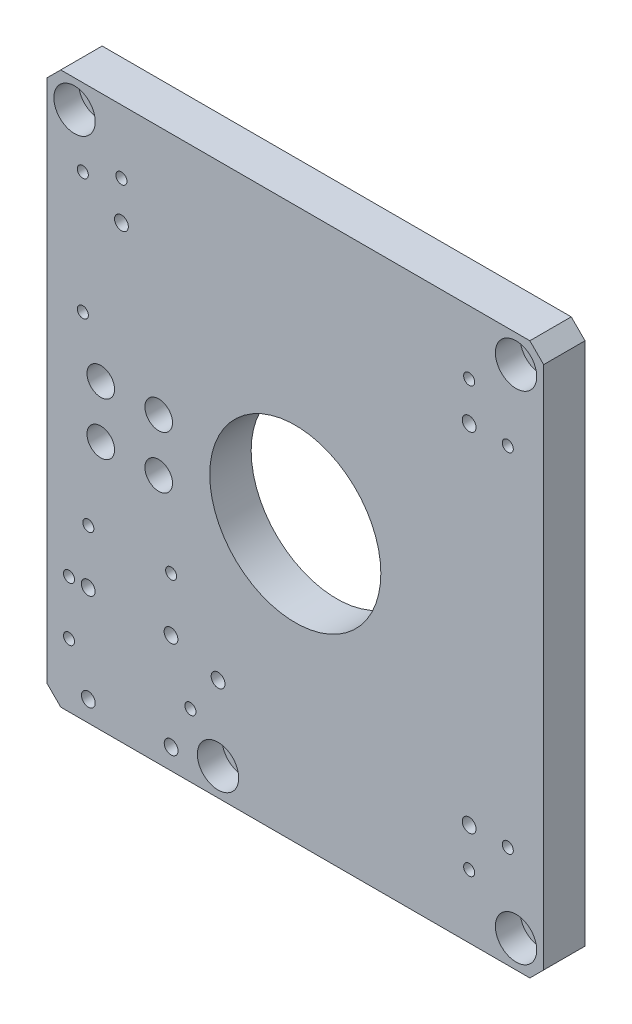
ISO-10303-21;
HEADER;
FILE_DESCRIPTION(('STEP AP214'),'2;1');
FILE_NAME('part.step','',(''),(''),'','','');
FILE_SCHEMA(('AUTOMOTIVE_DESIGN { 1 0 10303 214 1 1 1 1 }'));
ENDSEC;
DATA;
#1=APPLICATION_CONTEXT('core data for automotive mechanical design processes');
#2=APPLICATION_PROTOCOL_DEFINITION('international standard','automotive_design',2000,#1);
#3=PRODUCT_CONTEXT('',#1,'mechanical');
#4=PRODUCT('Part','Part','',(#3));
#5=PRODUCT_RELATED_PRODUCT_CATEGORY('part','',(#4));
#6=PRODUCT_DEFINITION_FORMATION('','',#4);
#7=PRODUCT_DEFINITION_CONTEXT('part definition',#1,'design');
#8=PRODUCT_DEFINITION('design','',#6,#7);
#9=PRODUCT_DEFINITION_SHAPE('','',#8);
#10=(LENGTH_UNIT() NAMED_UNIT(*) SI_UNIT(.MILLI.,.METRE.));
#11=(NAMED_UNIT(*) PLANE_ANGLE_UNIT() SI_UNIT($,.RADIAN.));
#12=(NAMED_UNIT(*) SI_UNIT($,.STERADIAN.) SOLID_ANGLE_UNIT());
#13=UNCERTAINTY_MEASURE_WITH_UNIT(LENGTH_MEASURE(1.E-05),#10,'distance_accuracy_value','');
#14=(GEOMETRIC_REPRESENTATION_CONTEXT(3) GLOBAL_UNCERTAINTY_ASSIGNED_CONTEXT((#13)) GLOBAL_UNIT_ASSIGNED_CONTEXT((#10,
#11,#12)) REPRESENTATION_CONTEXT('',''));
#15=CARTESIAN_POINT('',(0.,0.,0.));
#16=DIRECTION('',(0.,0.,1.));
#17=DIRECTION('',(1.,0.,0.));
#18=AXIS2_PLACEMENT_3D('',#15,#16,#17);
#19=CARTESIAN_POINT('',(-90.,100.,15.));
#20=DIRECTION('',(1.,0.,0.));
#21=DIRECTION('',(0.,1.,0.));
#22=AXIS2_PLACEMENT_3D('',#19,#20,#21);
#23=PLANE('',#22);
#24=CARTESIAN_POINT('',(-90.,-8.,7.5));
#25=DIRECTION('',(-1.,0.,0.));
#26=DIRECTION('',(0.,0.,1.));
#27=AXIS2_PLACEMENT_3D('',#24,#25,#26);
#28=CIRCLE('',#27,1.65);
#29=CARTESIAN_POINT('',(-90.,-8.,9.15));
#30=VERTEX_POINT('',#29);
#31=EDGE_CURVE('E945',#30,#30,#28,.T.);
#32=ORIENTED_EDGE('',*,*,#31,.F.);
#33=EDGE_LOOP('',(#32));
#34=FACE_BOUND('',#33,.T.);
#35=CARTESIAN_POINT('',(-90.,7.,7.5));
#36=DIRECTION('',(-1.,0.,0.));
#37=DIRECTION('',(0.,0.,1.));
#38=AXIS2_PLACEMENT_3D('',#35,#36,#37);
#39=CIRCLE('',#38,1.65);
#40=CARTESIAN_POINT('',(-90.,7.,9.15));
#41=VERTEX_POINT('',#40);
#42=EDGE_CURVE('E101',#41,#41,#39,.T.);
#43=ORIENTED_EDGE('',*,*,#42,.F.);
#44=EDGE_LOOP('',(#43));
#45=FACE_BOUND('',#44,.T.);
#46=DIRECTION('',(0.,-1.,0.));
#47=VECTOR('',#46,1.);
#48=CARTESIAN_POINT('',(-90.,100.,15.));
#49=LINE('',#48,#47);
#50=CARTESIAN_POINT('',(-90.,95.,15.));
#51=VERTEX_POINT('',#50);
#52=CARTESIAN_POINT('',(-90.,-95.,15.));
#53=VERTEX_POINT('',#52);
#54=EDGE_CURVE('E321',#51,#53,#49,.T.);
#55=ORIENTED_EDGE('',*,*,#54,.F.);
#56=DIRECTION('',(0.,0.,-1.));
#57=VECTOR('',#56,1.);
#58=CARTESIAN_POINT('',(-90.,95.,15.));
#59=LINE('',#58,#57);
#60=CARTESIAN_POINT('',(-90.,95.,0.));
#61=VERTEX_POINT('',#60);
#62=EDGE_CURVE('E11',#51,#61,#59,.T.);
#63=ORIENTED_EDGE('',*,*,#62,.T.);
#64=DIRECTION('',(0.,-1.,0.));
#65=VECTOR('',#64,1.);
#66=CARTESIAN_POINT('',(-90.,100.,0.));
#67=LINE('',#66,#65);
#68=CARTESIAN_POINT('',(-90.,-95.,0.));
#69=VERTEX_POINT('',#68);
#70=EDGE_CURVE('E320',#61,#69,#67,.T.);
#71=ORIENTED_EDGE('',*,*,#70,.T.);
#72=DIRECTION('',(0.,0.,1.));
#73=VECTOR('',#72,1.);
#74=CARTESIAN_POINT('',(-90.,-95.,15.));
#75=LINE('',#74,#73);
#76=EDGE_CURVE('E30',#69,#53,#75,.T.);
#77=ORIENTED_EDGE('',*,*,#76,.T.);
#78=EDGE_LOOP('',(#55,#63,#71,#77));
#79=FACE_BOUND('',#78,.T.);
#80=ADVANCED_FACE('F16',(#34,#45,#79),#23,.F.);
#81=CARTESIAN_POINT('',(90.,-100.,15.));
#82=DIRECTION('',(0.,1.,0.));
#83=DIRECTION('',(0.,0.,1.));
#84=AXIS2_PLACEMENT_3D('',#81,#82,#83);
#85=PLANE('',#84);
#86=DIRECTION('',(1.,0.,0.));
#87=VECTOR('',#86,1.);
#88=CARTESIAN_POINT('',(90.,-100.,0.));
#89=LINE('',#88,#87);
#90=CARTESIAN_POINT('',(-85.,-100.,0.));
#91=VERTEX_POINT('',#90);
#92=CARTESIAN_POINT('',(85.,-100.,0.));
#93=VERTEX_POINT('',#92);
#94=EDGE_CURVE('E335',#91,#93,#89,.T.);
#95=ORIENTED_EDGE('',*,*,#94,.T.);
#96=DIRECTION('',(0.,0.,1.));
#97=VECTOR('',#96,1.);
#98=CARTESIAN_POINT('',(85.,-100.,15.));
#99=LINE('',#98,#97);
#100=CARTESIAN_POINT('',(85.,-100.,15.));
#101=VERTEX_POINT('',#100);
#102=EDGE_CURVE('E37',#93,#101,#99,.T.);
#103=ORIENTED_EDGE('',*,*,#102,.T.);
#104=DIRECTION('',(1.,0.,0.));
#105=VECTOR('',#104,1.);
#106=CARTESIAN_POINT('',(90.,-100.,15.));
#107=LINE('',#106,#105);
#108=CARTESIAN_POINT('',(-85.,-100.,15.));
#109=VERTEX_POINT('',#108);
#110=EDGE_CURVE('E323',#109,#101,#107,.T.);
#111=ORIENTED_EDGE('',*,*,#110,.F.);
#112=DIRECTION('',(0.,0.,-1.));
#113=VECTOR('',#112,1.);
#114=CARTESIAN_POINT('',(-85.,-100.,15.));
#115=LINE('',#114,#113);
#116=EDGE_CURVE('E374',#109,#91,#115,.T.);
#117=ORIENTED_EDGE('',*,*,#116,.T.);
#118=EDGE_LOOP('',(#95,#103,#111,#117));
#119=FACE_BOUND('',#118,.T.);
#120=ADVANCED_FACE('F388',(#119),#85,.F.);
#121=CARTESIAN_POINT('',(90.,100.,15.));
#122=DIRECTION('',(-1.,0.,0.));
#123=DIRECTION('',(0.,-1.,0.));
#124=AXIS2_PLACEMENT_3D('',#121,#122,#123);
#125=PLANE('',#124);
#126=DIRECTION('',(0.,1.,0.));
#127=VECTOR('',#126,1.);
#128=CARTESIAN_POINT('',(90.,100.,0.));
#129=LINE('',#128,#127);
#130=CARTESIAN_POINT('',(90.,-95.,0.));
#131=VERTEX_POINT('',#130);
#132=CARTESIAN_POINT('',(90.,95.,0.));
#133=VERTEX_POINT('',#132);
#134=EDGE_CURVE('E337',#131,#133,#129,.T.);
#135=ORIENTED_EDGE('',*,*,#134,.T.);
#136=DIRECTION('',(0.,0.,1.));
#137=VECTOR('',#136,1.);
#138=CARTESIAN_POINT('',(90.,95.,15.));
#139=LINE('',#138,#137);
#140=CARTESIAN_POINT('',(90.,95.,15.));
#141=VERTEX_POINT('',#140);
#142=EDGE_CURVE('E365',#133,#141,#139,.T.);
#143=ORIENTED_EDGE('',*,*,#142,.T.);
#144=DIRECTION('',(0.,1.,0.));
#145=VECTOR('',#144,1.);
#146=CARTESIAN_POINT('',(90.,100.,15.));
#147=LINE('',#146,#145);
#148=CARTESIAN_POINT('',(90.,-95.,15.));
#149=VERTEX_POINT('',#148);
#150=EDGE_CURVE('E326',#149,#141,#147,.T.);
#151=ORIENTED_EDGE('',*,*,#150,.F.);
#152=DIRECTION('',(0.,0.,-1.));
#153=VECTOR('',#152,1.);
#154=CARTESIAN_POINT('',(90.,-95.,15.));
#155=LINE('',#154,#153);
#156=EDGE_CURVE('E362',#149,#131,#155,.T.);
#157=ORIENTED_EDGE('',*,*,#156,.T.);
#158=EDGE_LOOP('',(#135,#143,#151,#157));
#159=FACE_BOUND('',#158,.T.);
#160=ADVANCED_FACE('F399',(#159),#125,.F.);
#161=CARTESIAN_POINT('',(90.,100.,15.));
#162=DIRECTION('',(0.,-1.,0.));
#163=DIRECTION('',(1.,0.,0.));
#164=AXIS2_PLACEMENT_3D('',#161,#162,#163);
#165=PLANE('',#164);
#166=DIRECTION('',(-1.,0.,0.));
#167=VECTOR('',#166,1.);
#168=CARTESIAN_POINT('',(90.,100.,15.));
#169=LINE('',#168,#167);
#170=CARTESIAN_POINT('',(85.,100.,15.));
#171=VERTEX_POINT('',#170);
#172=CARTESIAN_POINT('',(-85.,100.,15.));
#173=VERTEX_POINT('',#172);
#174=EDGE_CURVE('E329',#171,#173,#169,.T.);
#175=ORIENTED_EDGE('',*,*,#174,.F.);
#176=DIRECTION('',(0.,0.,-1.));
#177=VECTOR('',#176,1.);
#178=CARTESIAN_POINT('',(85.,100.,15.));
#179=LINE('',#178,#177);
#180=CARTESIAN_POINT('',(85.,100.,0.));
#181=VERTEX_POINT('',#180);
#182=EDGE_CURVE('E351',#171,#181,#179,.T.);
#183=ORIENTED_EDGE('',*,*,#182,.T.);
#184=DIRECTION('',(-1.,0.,0.));
#185=VECTOR('',#184,1.);
#186=CARTESIAN_POINT('',(90.,100.,0.));
#187=LINE('',#186,#185);
#188=CARTESIAN_POINT('',(-85.,100.,0.));
#189=VERTEX_POINT('',#188);
#190=EDGE_CURVE('E324',#181,#189,#187,.T.);
#191=ORIENTED_EDGE('',*,*,#190,.T.);
#192=DIRECTION('',(0.,0.,1.));
#193=VECTOR('',#192,1.);
#194=CARTESIAN_POINT('',(-85.,100.,15.));
#195=LINE('',#194,#193);
#196=EDGE_CURVE('E332',#189,#173,#195,.T.);
#197=ORIENTED_EDGE('',*,*,#196,.T.);
#198=EDGE_LOOP('',(#175,#183,#191,#197));
#199=FACE_BOUND('',#198,.T.);
#200=ADVANCED_FACE('F407',(#199),#165,.F.);
#201=CARTESIAN_POINT('',(0.,0.,15.));
#202=DIRECTION('',(0.,0.,-1.));
#203=DIRECTION('',(-1.,0.,0.));
#204=AXIS2_PLACEMENT_3D('',#201,#202,#203);
#205=PLANE('',#204);
#206=CARTESIAN_POINT('',(-70.5000000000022,9.50000000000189,15.));
#207=DIRECTION('',(0.,0.,-1.));
#208=DIRECTION('',(-1.,0.,0.));
#209=AXIS2_PLACEMENT_3D('',#206,#207,#208);
#210=CIRCLE('',#209,5.);
#211=CARTESIAN_POINT('',(-75.5000000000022,9.50000000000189,15.));
#212=VERTEX_POINT('',#211);
#213=EDGE_CURVE('E104',#212,#212,#210,.T.);
#214=ORIENTED_EDGE('',*,*,#213,.T.);
#215=EDGE_LOOP('',(#214));
#216=FACE_BOUND('',#215,.T.);
#217=CARTESIAN_POINT('',(-70.5000000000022,-9.49999999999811,15.));
#218=DIRECTION('',(0.,0.,-1.));
#219=DIRECTION('',(-1.,0.,0.));
#220=AXIS2_PLACEMENT_3D('',#217,#218,#219);
#221=CIRCLE('',#220,5.);
#222=CARTESIAN_POINT('',(-75.5000000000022,-9.49999999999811,15.));
#223=VERTEX_POINT('',#222);
#224=EDGE_CURVE('E113',#223,#223,#221,.T.);
#225=ORIENTED_EDGE('',*,*,#224,.T.);
#226=EDGE_LOOP('',(#225));
#227=FACE_BOUND('',#226,.T.);
#228=CARTESIAN_POINT('',(-49.5000000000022,9.50000000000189,15.));
#229=DIRECTION('',(0.,0.,-1.));
#230=DIRECTION('',(-1.,0.,0.));
#231=AXIS2_PLACEMENT_3D('',#228,#229,#230);
#232=CIRCLE('',#231,5.);
#233=CARTESIAN_POINT('',(-54.5000000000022,9.50000000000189,15.));
#234=VERTEX_POINT('',#233);
#235=EDGE_CURVE('E119',#234,#234,#232,.T.);
#236=ORIENTED_EDGE('',*,*,#235,.T.);
#237=EDGE_LOOP('',(#236));
#238=FACE_BOUND('',#237,.T.);
#239=CARTESIAN_POINT('',(-49.5000000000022,-9.49999999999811,15.));
#240=DIRECTION('',(0.,0.,-1.));
#241=DIRECTION('',(-1.,0.,0.));
#242=AXIS2_PLACEMENT_3D('',#239,#240,#241);
#243=CIRCLE('',#242,5.);
#244=CARTESIAN_POINT('',(-54.5000000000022,-9.49999999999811,15.));
#245=VERTEX_POINT('',#244);
#246=EDGE_CURVE('E125',#245,#245,#243,.T.);
#247=ORIENTED_EDGE('',*,*,#246,.T.);
#248=EDGE_LOOP('',(#247));
#249=FACE_BOUND('',#248,.T.);
#250=CARTESIAN_POINT('',(80.,90.,15.));
#251=DIRECTION('',(0.,0.,1.));
#252=DIRECTION('',(1.,0.,0.));
#253=AXIS2_PLACEMENT_3D('',#250,#251,#252);
#254=CIRCLE('',#253,7.5);
#255=CARTESIAN_POINT('',(87.5,90.,15.));
#256=VERTEX_POINT('',#255);
#257=EDGE_CURVE('E128',#256,#256,#254,.T.);
#258=ORIENTED_EDGE('',*,*,#257,.F.);
#259=EDGE_LOOP('',(#258));
#260=FACE_BOUND('',#259,.T.);
#261=CARTESIAN_POINT('',(80.,-90.,15.));
#262=DIRECTION('',(0.,0.,1.));
#263=DIRECTION('',(1.,0.,0.));
#264=AXIS2_PLACEMENT_3D('',#261,#262,#263);
#265=CIRCLE('',#264,7.5);
#266=CARTESIAN_POINT('',(87.5,-90.,15.));
#267=VERTEX_POINT('',#266);
#268=EDGE_CURVE('E140',#267,#267,#265,.T.);
#269=ORIENTED_EDGE('',*,*,#268,.F.);
#270=EDGE_LOOP('',(#269));
#271=FACE_BOUND('',#270,.T.);
#272=CARTESIAN_POINT('',(-28.,-90.,15.));
#273=DIRECTION('',(0.,0.,1.));
#274=DIRECTION('',(1.,0.,0.));
#275=AXIS2_PLACEMENT_3D('',#272,#273,#274);
#276=CIRCLE('',#275,7.5);
#277=CARTESIAN_POINT('',(-20.5,-90.,15.));
#278=VERTEX_POINT('',#277);
#279=EDGE_CURVE('E150',#278,#278,#276,.T.);
#280=ORIENTED_EDGE('',*,*,#279,.F.);
#281=EDGE_LOOP('',(#280));
#282=FACE_BOUND('',#281,.T.);
#283=CARTESIAN_POINT('',(-80.,90.,15.));
#284=DIRECTION('',(0.,0.,1.));
#285=DIRECTION('',(1.,0.,0.));
#286=AXIS2_PLACEMENT_3D('',#283,#284,#285);
#287=CIRCLE('',#286,7.5);
#288=CARTESIAN_POINT('',(-72.5,90.,15.));
#289=VERTEX_POINT('',#288);
#290=EDGE_CURVE('E160',#289,#289,#287,.T.);
#291=ORIENTED_EDGE('',*,*,#290,.F.);
#292=EDGE_LOOP('',(#291));
#293=FACE_BOUND('',#292,.T.);
#294=CARTESIAN_POINT('',(-38.,-77.,15.));
#295=DIRECTION('',(0.,0.,-1.));
#296=DIRECTION('',(-1.,0.,0.));
#297=AXIS2_PLACEMENT_3D('',#294,#295,#296);
#298=CIRCLE('',#297,2.);
#299=CARTESIAN_POINT('',(-40.,-77.,15.));
#300=VERTEX_POINT('',#299);
#301=EDGE_CURVE('E197',#300,#300,#298,.T.);
#302=ORIENTED_EDGE('',*,*,#301,.T.);
#303=EDGE_LOOP('',(#302));
#304=FACE_BOUND('',#303,.T.);
#305=CARTESIAN_POINT('',(-77.,28.,15.));
#306=DIRECTION('',(0.,0.,-1.));
#307=DIRECTION('',(-1.,0.,0.));
#308=AXIS2_PLACEMENT_3D('',#305,#306,#307);
#309=CIRCLE('',#308,2.);
#310=CARTESIAN_POINT('',(-79.,28.,15.));
#311=VERTEX_POINT('',#310);
#312=EDGE_CURVE('E203',#311,#311,#309,.T.);
#313=ORIENTED_EDGE('',*,*,#312,.T.);
#314=EDGE_LOOP('',(#313));
#315=FACE_BOUND('',#314,.T.);
#316=CARTESIAN_POINT('',(-77.,72.,15.));
#317=DIRECTION('',(0.,0.,-1.));
#318=DIRECTION('',(-1.,0.,0.));
#319=AXIS2_PLACEMENT_3D('',#316,#317,#318);
#320=CIRCLE('',#319,2.);
#321=CARTESIAN_POINT('',(-79.,72.,15.));
#322=VERTEX_POINT('',#321);
#323=EDGE_CURVE('E209',#322,#322,#320,.T.);
#324=ORIENTED_EDGE('',*,*,#323,.T.);
#325=EDGE_LOOP('',(#324));
#326=FACE_BOUND('',#325,.T.);
#327=CARTESIAN_POINT('',(-63.,77.,15.));
#328=DIRECTION('',(0.,0.,-1.));
#329=DIRECTION('',(-1.,0.,0.));
#330=AXIS2_PLACEMENT_3D('',#327,#328,#329);
#331=CIRCLE('',#330,2.);
#332=CARTESIAN_POINT('',(-65.,77.,15.));
#333=VERTEX_POINT('',#332);
#334=EDGE_CURVE('E215',#333,#333,#331,.T.);
#335=ORIENTED_EDGE('',*,*,#334,.T.);
#336=EDGE_LOOP('',(#335));
#337=FACE_BOUND('',#336,.T.);
#338=CARTESIAN_POINT('',(63.,77.,15.));
#339=DIRECTION('',(0.,0.,-1.));
#340=DIRECTION('',(-1.,0.,0.));
#341=AXIS2_PLACEMENT_3D('',#338,#339,#340);
#342=CIRCLE('',#341,2.);
#343=CARTESIAN_POINT('',(61.,77.,15.));
#344=VERTEX_POINT('',#343);
#345=EDGE_CURVE('E221',#344,#344,#342,.T.);
#346=ORIENTED_EDGE('',*,*,#345,.T.);
#347=EDGE_LOOP('',(#346));
#348=FACE_BOUND('',#347,.T.);
#349=CARTESIAN_POINT('',(63.,-77.,15.));
#350=DIRECTION('',(0.,0.,-1.));
#351=DIRECTION('',(-1.,0.,0.));
#352=AXIS2_PLACEMENT_3D('',#349,#350,#351);
#353=CIRCLE('',#352,2.);
#354=CARTESIAN_POINT('',(61.,-77.,15.));
#355=VERTEX_POINT('',#354);
#356=EDGE_CURVE('E227',#355,#355,#353,.T.);
#357=ORIENTED_EDGE('',*,*,#356,.T.);
#358=EDGE_LOOP('',(#357));
#359=FACE_BOUND('',#358,.T.);
#360=CARTESIAN_POINT('',(-82.,-77.,15.));
#361=DIRECTION('',(0.,0.,-1.));
#362=DIRECTION('',(-1.,0.,0.));
#363=AXIS2_PLACEMENT_3D('',#360,#361,#362);
#364=CIRCLE('',#363,2.);
#365=CARTESIAN_POINT('',(-84.,-77.,15.));
#366=VERTEX_POINT('',#365);
#367=EDGE_CURVE('E233',#366,#366,#364,.T.);
#368=ORIENTED_EDGE('',*,*,#367,.T.);
#369=EDGE_LOOP('',(#368));
#370=FACE_BOUND('',#369,.T.);
#371=CARTESIAN_POINT('',(-82.,-57.5,15.));
#372=DIRECTION('',(0.,0.,-1.));
#373=DIRECTION('',(-1.,0.,0.));
#374=AXIS2_PLACEMENT_3D('',#371,#372,#373);
#375=CIRCLE('',#374,2.);
#376=CARTESIAN_POINT('',(-84.,-57.5,15.));
#377=VERTEX_POINT('',#376);
#378=EDGE_CURVE('E239',#377,#377,#375,.T.);
#379=ORIENTED_EDGE('',*,*,#378,.T.);
#380=EDGE_LOOP('',(#379));
#381=FACE_BOUND('',#380,.T.);
#382=CARTESIAN_POINT('',(-45.,-38.,15.));
#383=DIRECTION('',(0.,0.,-1.));
#384=DIRECTION('',(-1.,0.,0.));
#385=AXIS2_PLACEMENT_3D('',#382,#383,#384);
#386=CIRCLE('',#385,2.);
#387=CARTESIAN_POINT('',(-47.,-38.,15.));
#388=VERTEX_POINT('',#387);
#389=EDGE_CURVE('E245',#388,#388,#386,.T.);
#390=ORIENTED_EDGE('',*,*,#389,.T.);
#391=EDGE_LOOP('',(#390));
#392=FACE_BOUND('',#391,.T.);
#393=CARTESIAN_POINT('',(-75.,-38.,15.));
#394=DIRECTION('',(0.,0.,-1.));
#395=DIRECTION('',(-1.,0.,0.));
#396=AXIS2_PLACEMENT_3D('',#393,#394,#395);
#397=CIRCLE('',#396,2.);
#398=CARTESIAN_POINT('',(-77.,-38.,15.));
#399=VERTEX_POINT('',#398);
#400=EDGE_CURVE('E251',#399,#399,#397,.T.);
#401=ORIENTED_EDGE('',*,*,#400,.T.);
#402=EDGE_LOOP('',(#401));
#403=FACE_BOUND('',#402,.T.);
#404=CARTESIAN_POINT('',(77.,-63.,15.));
#405=DIRECTION('',(0.,0.,-1.));
#406=DIRECTION('',(-1.,0.,0.));
#407=AXIS2_PLACEMENT_3D('',#404,#405,#406);
#408=CIRCLE('',#407,2.);
#409=CARTESIAN_POINT('',(75.,-63.,15.));
#410=VERTEX_POINT('',#409);
#411=EDGE_CURVE('E257',#410,#410,#408,.T.);
#412=ORIENTED_EDGE('',*,*,#411,.T.);
#413=EDGE_LOOP('',(#412));
#414=FACE_BOUND('',#413,.T.);
#415=CARTESIAN_POINT('',(77.,63.,15.));
#416=DIRECTION('',(0.,0.,-1.));
#417=DIRECTION('',(-1.,0.,0.));
#418=AXIS2_PLACEMENT_3D('',#415,#416,#417);
#419=CIRCLE('',#418,2.);
#420=CARTESIAN_POINT('',(75.,63.,15.));
#421=VERTEX_POINT('',#420);
#422=EDGE_CURVE('E263',#421,#421,#419,.T.);
#423=ORIENTED_EDGE('',*,*,#422,.T.);
#424=EDGE_LOOP('',(#423));
#425=FACE_BOUND('',#424,.T.);
#426=CARTESIAN_POINT('',(0.,0.,15.));
#427=DIRECTION('',(0.,0.,-1.));
#428=DIRECTION('',(-1.,0.,0.));
#429=AXIS2_PLACEMENT_3D('',#426,#427,#428);
#430=CIRCLE('',#429,31.);
#431=CARTESIAN_POINT('',(-31.,0.,15.));
#432=VERTEX_POINT('',#431);
#433=EDGE_CURVE('E267',#432,#432,#430,.T.);
#434=ORIENTED_EDGE('',*,*,#433,.T.);
#435=EDGE_LOOP('',(#434));
#436=FACE_BOUND('',#435,.T.);
#437=CARTESIAN_POINT('',(-75.,-92.5,15.));
#438=DIRECTION('',(0.,0.,1.));
#439=DIRECTION('',(1.,0.,0.));
#440=AXIS2_PLACEMENT_3D('',#437,#438,#439);
#441=CIRCLE('',#440,2.5);
#442=CARTESIAN_POINT('',(-72.5,-92.5,15.));
#443=VERTEX_POINT('',#442);
#444=EDGE_CURVE('E270',#443,#443,#441,.T.);
#445=ORIENTED_EDGE('',*,*,#444,.F.);
#446=EDGE_LOOP('',(#445));
#447=FACE_BOUND('',#446,.T.);
#448=CARTESIAN_POINT('',(-75.0521398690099,-57.5,15.));
#449=DIRECTION('',(0.,0.,1.));
#450=DIRECTION('',(1.,0.,0.));
#451=AXIS2_PLACEMENT_3D('',#448,#449,#450);
#452=CIRCLE('',#451,2.5);
#453=CARTESIAN_POINT('',(-72.5521398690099,-57.5,15.));
#454=VERTEX_POINT('',#453);
#455=EDGE_CURVE('E278',#454,#454,#452,.T.);
#456=ORIENTED_EDGE('',*,*,#455,.F.);
#457=EDGE_LOOP('',(#456));
#458=FACE_BOUND('',#457,.T.);
#459=CARTESIAN_POINT('',(-45.0521398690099,-57.5,15.));
#460=DIRECTION('',(0.,0.,1.));
#461=DIRECTION('',(1.,0.,0.));
#462=AXIS2_PLACEMENT_3D('',#459,#460,#461);
#463=CIRCLE('',#462,2.5);
#464=CARTESIAN_POINT('',(-42.5521398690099,-57.5,15.));
#465=VERTEX_POINT('',#464);
#466=EDGE_CURVE('E284',#465,#465,#463,.T.);
#467=ORIENTED_EDGE('',*,*,#466,.F.);
#468=EDGE_LOOP('',(#467));
#469=FACE_BOUND('',#468,.T.);
#470=CARTESIAN_POINT('',(-45.,-92.5,15.));
#471=DIRECTION('',(0.,0.,1.));
#472=DIRECTION('',(1.,0.,0.));
#473=AXIS2_PLACEMENT_3D('',#470,#471,#472);
#474=CIRCLE('',#473,2.5);
#475=CARTESIAN_POINT('',(-42.5,-92.5,15.));
#476=VERTEX_POINT('',#475);
#477=EDGE_CURVE('E290',#476,#476,#474,.T.);
#478=ORIENTED_EDGE('',*,*,#477,.F.);
#479=EDGE_LOOP('',(#478));
#480=FACE_BOUND('',#479,.T.);
#481=CARTESIAN_POINT('',(-28.,-63.,15.));
#482=DIRECTION('',(0.,0.,1.));
#483=DIRECTION('',(1.,0.,0.));
#484=AXIS2_PLACEMENT_3D('',#481,#482,#483);
#485=CIRCLE('',#484,2.5);
#486=CARTESIAN_POINT('',(-25.5,-63.,15.));
#487=VERTEX_POINT('',#486);
#488=EDGE_CURVE('E296',#487,#487,#485,.T.);
#489=ORIENTED_EDGE('',*,*,#488,.F.);
#490=EDGE_LOOP('',(#489));
#491=FACE_BOUND('',#490,.T.);
#492=CARTESIAN_POINT('',(63.,-63.,15.));
#493=DIRECTION('',(0.,0.,1.));
#494=DIRECTION('',(1.,0.,0.));
#495=AXIS2_PLACEMENT_3D('',#492,#493,#494);
#496=CIRCLE('',#495,2.5);
#497=CARTESIAN_POINT('',(65.5,-63.,15.));
#498=VERTEX_POINT('',#497);
#499=EDGE_CURVE('E302',#498,#498,#496,.T.);
#500=ORIENTED_EDGE('',*,*,#499,.F.);
#501=EDGE_LOOP('',(#500));
#502=FACE_BOUND('',#501,.T.);
#503=CARTESIAN_POINT('',(63.,63.,15.));
#504=DIRECTION('',(0.,0.,1.));
#505=DIRECTION('',(1.,0.,0.));
#506=AXIS2_PLACEMENT_3D('',#503,#504,#505);
#507=CIRCLE('',#506,2.5);
#508=CARTESIAN_POINT('',(65.5,63.,15.));
#509=VERTEX_POINT('',#508);
#510=EDGE_CURVE('E308',#509,#509,#507,.T.);
#511=ORIENTED_EDGE('',*,*,#510,.F.);
#512=EDGE_LOOP('',(#511));
#513=FACE_BOUND('',#512,.T.);
#514=CARTESIAN_POINT('',(-63.,63.,15.));
#515=DIRECTION('',(0.,0.,1.));
#516=DIRECTION('',(1.,0.,0.));
#517=AXIS2_PLACEMENT_3D('',#514,#515,#516);
#518=CIRCLE('',#517,2.5);
#519=CARTESIAN_POINT('',(-60.5,63.,15.));
#520=VERTEX_POINT('',#519);
#521=EDGE_CURVE('E314',#520,#520,#518,.T.);
#522=ORIENTED_EDGE('',*,*,#521,.F.);
#523=EDGE_LOOP('',(#522));
#524=FACE_BOUND('',#523,.T.);
#525=ORIENTED_EDGE('',*,*,#150,.T.);
#526=DIRECTION('',(0.707106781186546,-0.70710678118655,0.));
#527=VECTOR('',#526,1.);
#528=CARTESIAN_POINT('',(85.,100.,15.));
#529=LINE('',#528,#527);
#530=EDGE_CURVE('E372',#141,#171,#529,.F.);
#531=ORIENTED_EDGE('',*,*,#530,.T.);
#532=ORIENTED_EDGE('',*,*,#174,.T.);
#533=DIRECTION('',(0.70710678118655,0.707106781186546,0.));
#534=VECTOR('',#533,1.);
#535=CARTESIAN_POINT('',(-90.,95.,15.));
#536=LINE('',#535,#534);
#537=EDGE_CURVE('E368',#173,#51,#536,.F.);
#538=ORIENTED_EDGE('',*,*,#537,.T.);
#539=ORIENTED_EDGE('',*,*,#54,.T.);
#540=DIRECTION('',(-0.707106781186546,0.70710678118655,0.));
#541=VECTOR('',#540,1.);
#542=CARTESIAN_POINT('',(-85.,-100.,15.));
#543=LINE('',#542,#541);
#544=EDGE_CURVE('E44',#53,#109,#543,.F.);
#545=ORIENTED_EDGE('',*,*,#544,.T.);
#546=ORIENTED_EDGE('',*,*,#110,.T.);
#547=DIRECTION('',(-0.70710678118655,-0.707106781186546,0.));
#548=VECTOR('',#547,1.);
#549=CARTESIAN_POINT('',(90.,-95.,15.));
#550=LINE('',#549,#548);
#551=EDGE_CURVE('E370',#101,#149,#550,.F.);
#552=ORIENTED_EDGE('',*,*,#551,.T.);
#553=EDGE_LOOP('',(#525,#531,#532,#538,#539,#545,#546,#552));
#554=FACE_BOUND('',#553,.T.);
#555=ADVANCED_FACE('F384',(#216,#227,#238,#249,#260,#271,#282,#293,#304,#315,#326,#337,#348,
#359,#370,#381,#392,#403,#414,#425,#436,#447,#458,#469,#480,#491,#502,#513,#524,#554),#205,.F.);
#556=CARTESIAN_POINT('',(0.,0.,0.));
#557=DIRECTION('',(0.,0.,-1.));
#558=DIRECTION('',(-1.,0.,0.));
#559=AXIS2_PLACEMENT_3D('',#556,#557,#558);
#560=PLANE('',#559);
#561=CARTESIAN_POINT('',(-70.5000000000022,9.50000000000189,0.));
#562=DIRECTION('',(0.,0.,-1.));
#563=DIRECTION('',(-1.,0.,0.));
#564=AXIS2_PLACEMENT_3D('',#561,#562,#563);
#565=CIRCLE('',#564,5.);
#566=CARTESIAN_POINT('',(-75.5000000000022,9.50000000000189,0.));
#567=VERTEX_POINT('',#566);
#568=EDGE_CURVE('E100',#567,#567,#565,.T.);
#569=ORIENTED_EDGE('',*,*,#568,.F.);
#570=EDGE_LOOP('',(#569));
#571=FACE_BOUND('',#570,.T.);
#572=CARTESIAN_POINT('',(-70.5000000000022,-9.49999999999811,0.));
#573=DIRECTION('',(0.,0.,-1.));
#574=DIRECTION('',(-1.,0.,0.));
#575=AXIS2_PLACEMENT_3D('',#572,#573,#574);
#576=CIRCLE('',#575,5.);
#577=CARTESIAN_POINT('',(-75.5000000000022,-9.49999999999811,0.));
#578=VERTEX_POINT('',#577);
#579=EDGE_CURVE('E111',#578,#578,#576,.T.);
#580=ORIENTED_EDGE('',*,*,#579,.F.);
#581=EDGE_LOOP('',(#580));
#582=FACE_BOUND('',#581,.T.);
#583=CARTESIAN_POINT('',(-49.5000000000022,9.50000000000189,0.));
#584=DIRECTION('',(0.,0.,-1.));
#585=DIRECTION('',(-1.,0.,0.));
#586=AXIS2_PLACEMENT_3D('',#583,#584,#585);
#587=CIRCLE('',#586,5.);
#588=CARTESIAN_POINT('',(-54.5000000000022,9.50000000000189,0.));
#589=VERTEX_POINT('',#588);
#590=EDGE_CURVE('E116',#589,#589,#587,.T.);
#591=ORIENTED_EDGE('',*,*,#590,.F.);
#592=EDGE_LOOP('',(#591));
#593=FACE_BOUND('',#592,.T.);
#594=CARTESIAN_POINT('',(-49.5000000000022,-9.49999999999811,0.));
#595=DIRECTION('',(0.,0.,-1.));
#596=DIRECTION('',(-1.,0.,0.));
#597=AXIS2_PLACEMENT_3D('',#594,#595,#596);
#598=CIRCLE('',#597,5.);
#599=CARTESIAN_POINT('',(-54.5000000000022,-9.49999999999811,0.));
#600=VERTEX_POINT('',#599);
#601=EDGE_CURVE('E122',#600,#600,#598,.T.);
#602=ORIENTED_EDGE('',*,*,#601,.F.);
#603=EDGE_LOOP('',(#602));
#604=FACE_BOUND('',#603,.T.);
#605=CARTESIAN_POINT('',(-80.,90.,0.));
#606=DIRECTION('',(0.,0.,-1.));
#607=DIRECTION('',(-1.,0.,0.));
#608=AXIS2_PLACEMENT_3D('',#605,#606,#607);
#609=CIRCLE('',#608,7.5);
#610=CARTESIAN_POINT('',(-87.5,90.,0.));
#611=VERTEX_POINT('',#610);
#612=EDGE_CURVE('E174',#611,#611,#609,.T.);
#613=ORIENTED_EDGE('',*,*,#612,.F.);
#614=EDGE_LOOP('',(#613));
#615=FACE_BOUND('',#614,.T.);
#616=CARTESIAN_POINT('',(-28.,-90.,0.));
#617=DIRECTION('',(0.,0.,-1.));
#618=DIRECTION('',(-1.,0.,0.));
#619=AXIS2_PLACEMENT_3D('',#616,#617,#618);
#620=CIRCLE('',#619,7.5);
#621=CARTESIAN_POINT('',(-35.5,-90.,0.));
#622=VERTEX_POINT('',#621);
#623=EDGE_CURVE('E173',#622,#622,#620,.T.);
#624=ORIENTED_EDGE('',*,*,#623,.F.);
#625=EDGE_LOOP('',(#624));
#626=FACE_BOUND('',#625,.T.);
#627=CARTESIAN_POINT('',(80.,-90.,0.));
#628=DIRECTION('',(0.,0.,-1.));
#629=DIRECTION('',(-1.,0.,0.));
#630=AXIS2_PLACEMENT_3D('',#627,#628,#629);
#631=CIRCLE('',#630,7.5);
#632=CARTESIAN_POINT('',(72.5,-90.,0.));
#633=VERTEX_POINT('',#632);
#634=EDGE_CURVE('E180',#633,#633,#631,.T.);
#635=ORIENTED_EDGE('',*,*,#634,.F.);
#636=EDGE_LOOP('',(#635));
#637=FACE_BOUND('',#636,.T.);
#638=CARTESIAN_POINT('',(80.,90.,0.));
#639=DIRECTION('',(0.,0.,-1.));
#640=DIRECTION('',(-1.,0.,0.));
#641=AXIS2_PLACEMENT_3D('',#638,#639,#640);
#642=CIRCLE('',#641,7.5);
#643=CARTESIAN_POINT('',(72.5,90.,0.));
#644=VERTEX_POINT('',#643);
#645=EDGE_CURVE('E186',#644,#644,#642,.T.);
#646=ORIENTED_EDGE('',*,*,#645,.F.);
#647=EDGE_LOOP('',(#646));
#648=FACE_BOUND('',#647,.T.);
#649=CARTESIAN_POINT('',(-38.,-77.,0.));
#650=DIRECTION('',(0.,0.,-1.));
#651=DIRECTION('',(-1.,0.,0.));
#652=AXIS2_PLACEMENT_3D('',#649,#650,#651);
#653=CIRCLE('',#652,2.);
#654=CARTESIAN_POINT('',(-40.,-77.,0.));
#655=VERTEX_POINT('',#654);
#656=EDGE_CURVE('E192',#655,#655,#653,.T.);
#657=ORIENTED_EDGE('',*,*,#656,.F.);
#658=EDGE_LOOP('',(#657));
#659=FACE_BOUND('',#658,.T.);
#660=CARTESIAN_POINT('',(-77.,28.,0.));
#661=DIRECTION('',(0.,0.,-1.));
#662=DIRECTION('',(-1.,0.,0.));
#663=AXIS2_PLACEMENT_3D('',#660,#661,#662);
#664=CIRCLE('',#663,2.);
#665=CARTESIAN_POINT('',(-79.,28.,0.));
#666=VERTEX_POINT('',#665);
#667=EDGE_CURVE('E200',#666,#666,#664,.T.);
#668=ORIENTED_EDGE('',*,*,#667,.F.);
#669=EDGE_LOOP('',(#668));
#670=FACE_BOUND('',#669,.T.);
#671=CARTESIAN_POINT('',(-77.,72.,0.));
#672=DIRECTION('',(0.,0.,-1.));
#673=DIRECTION('',(-1.,0.,0.));
#674=AXIS2_PLACEMENT_3D('',#671,#672,#673);
#675=CIRCLE('',#674,2.);
#676=CARTESIAN_POINT('',(-79.,72.,0.));
#677=VERTEX_POINT('',#676);
#678=EDGE_CURVE('E206',#677,#677,#675,.T.);
#679=ORIENTED_EDGE('',*,*,#678,.F.);
#680=EDGE_LOOP('',(#679));
#681=FACE_BOUND('',#680,.T.);
#682=CARTESIAN_POINT('',(-63.,77.,0.));
#683=DIRECTION('',(0.,0.,-1.));
#684=DIRECTION('',(-1.,0.,0.));
#685=AXIS2_PLACEMENT_3D('',#682,#683,#684);
#686=CIRCLE('',#685,2.);
#687=CARTESIAN_POINT('',(-65.,77.,0.));
#688=VERTEX_POINT('',#687);
#689=EDGE_CURVE('E212',#688,#688,#686,.T.);
#690=ORIENTED_EDGE('',*,*,#689,.F.);
#691=EDGE_LOOP('',(#690));
#692=FACE_BOUND('',#691,.T.);
#693=CARTESIAN_POINT('',(63.,77.,0.));
#694=DIRECTION('',(0.,0.,-1.));
#695=DIRECTION('',(-1.,0.,0.));
#696=AXIS2_PLACEMENT_3D('',#693,#694,#695);
#697=CIRCLE('',#696,2.);
#698=CARTESIAN_POINT('',(61.,77.,0.));
#699=VERTEX_POINT('',#698);
#700=EDGE_CURVE('E218',#699,#699,#697,.T.);
#701=ORIENTED_EDGE('',*,*,#700,.F.);
#702=EDGE_LOOP('',(#701));
#703=FACE_BOUND('',#702,.T.);
#704=CARTESIAN_POINT('',(63.,-77.,0.));
#705=DIRECTION('',(0.,0.,-1.));
#706=DIRECTION('',(-1.,0.,0.));
#707=AXIS2_PLACEMENT_3D('',#704,#705,#706);
#708=CIRCLE('',#707,2.);
#709=CARTESIAN_POINT('',(61.,-77.,0.));
#710=VERTEX_POINT('',#709);
#711=EDGE_CURVE('E224',#710,#710,#708,.T.);
#712=ORIENTED_EDGE('',*,*,#711,.F.);
#713=EDGE_LOOP('',(#712));
#714=FACE_BOUND('',#713,.T.);
#715=CARTESIAN_POINT('',(-82.,-77.,0.));
#716=DIRECTION('',(0.,0.,-1.));
#717=DIRECTION('',(-1.,0.,0.));
#718=AXIS2_PLACEMENT_3D('',#715,#716,#717);
#719=CIRCLE('',#718,2.);
#720=CARTESIAN_POINT('',(-84.,-77.,0.));
#721=VERTEX_POINT('',#720);
#722=EDGE_CURVE('E230',#721,#721,#719,.T.);
#723=ORIENTED_EDGE('',*,*,#722,.F.);
#724=EDGE_LOOP('',(#723));
#725=FACE_BOUND('',#724,.T.);
#726=CARTESIAN_POINT('',(-82.,-57.5,0.));
#727=DIRECTION('',(0.,0.,-1.));
#728=DIRECTION('',(-1.,0.,0.));
#729=AXIS2_PLACEMENT_3D('',#726,#727,#728);
#730=CIRCLE('',#729,2.);
#731=CARTESIAN_POINT('',(-84.,-57.5,0.));
#732=VERTEX_POINT('',#731);
#733=EDGE_CURVE('E236',#732,#732,#730,.T.);
#734=ORIENTED_EDGE('',*,*,#733,.F.);
#735=EDGE_LOOP('',(#734));
#736=FACE_BOUND('',#735,.T.);
#737=CARTESIAN_POINT('',(-45.,-38.,0.));
#738=DIRECTION('',(0.,0.,-1.));
#739=DIRECTION('',(-1.,0.,0.));
#740=AXIS2_PLACEMENT_3D('',#737,#738,#739);
#741=CIRCLE('',#740,2.);
#742=CARTESIAN_POINT('',(-47.,-38.,0.));
#743=VERTEX_POINT('',#742);
#744=EDGE_CURVE('E242',#743,#743,#741,.T.);
#745=ORIENTED_EDGE('',*,*,#744,.F.);
#746=EDGE_LOOP('',(#745));
#747=FACE_BOUND('',#746,.T.);
#748=CARTESIAN_POINT('',(-75.,-38.,0.));
#749=DIRECTION('',(0.,0.,-1.));
#750=DIRECTION('',(-1.,0.,0.));
#751=AXIS2_PLACEMENT_3D('',#748,#749,#750);
#752=CIRCLE('',#751,2.);
#753=CARTESIAN_POINT('',(-77.,-38.,0.));
#754=VERTEX_POINT('',#753);
#755=EDGE_CURVE('E248',#754,#754,#752,.T.);
#756=ORIENTED_EDGE('',*,*,#755,.F.);
#757=EDGE_LOOP('',(#756));
#758=FACE_BOUND('',#757,.T.);
#759=CARTESIAN_POINT('',(77.,-63.,0.));
#760=DIRECTION('',(0.,0.,-1.));
#761=DIRECTION('',(-1.,0.,0.));
#762=AXIS2_PLACEMENT_3D('',#759,#760,#761);
#763=CIRCLE('',#762,2.);
#764=CARTESIAN_POINT('',(75.,-63.,0.));
#765=VERTEX_POINT('',#764);
#766=EDGE_CURVE('E254',#765,#765,#763,.T.);
#767=ORIENTED_EDGE('',*,*,#766,.F.);
#768=EDGE_LOOP('',(#767));
#769=FACE_BOUND('',#768,.T.);
#770=CARTESIAN_POINT('',(77.,63.,0.));
#771=DIRECTION('',(0.,0.,-1.));
#772=DIRECTION('',(-1.,0.,0.));
#773=AXIS2_PLACEMENT_3D('',#770,#771,#772);
#774=CIRCLE('',#773,2.);
#775=CARTESIAN_POINT('',(75.,63.,0.));
#776=VERTEX_POINT('',#775);
#777=EDGE_CURVE('E260',#776,#776,#774,.T.);
#778=ORIENTED_EDGE('',*,*,#777,.F.);
#779=EDGE_LOOP('',(#778));
#780=FACE_BOUND('',#779,.T.);
#781=CARTESIAN_POINT('',(0.,0.,0.));
#782=DIRECTION('',(0.,0.,-1.));
#783=DIRECTION('',(-1.,0.,0.));
#784=AXIS2_PLACEMENT_3D('',#781,#782,#783);
#785=CIRCLE('',#784,31.);
#786=CARTESIAN_POINT('',(-31.,0.,0.));
#787=VERTEX_POINT('',#786);
#788=EDGE_CURVE('E266',#787,#787,#785,.T.);
#789=ORIENTED_EDGE('',*,*,#788,.F.);
#790=EDGE_LOOP('',(#789));
#791=FACE_BOUND('',#790,.T.);
#792=CARTESIAN_POINT('',(-75.,-92.5,0.));
#793=DIRECTION('',(0.,0.,1.));
#794=DIRECTION('',(1.,0.,0.));
#795=AXIS2_PLACEMENT_3D('',#792,#793,#794);
#796=CIRCLE('',#795,2.5);
#797=CARTESIAN_POINT('',(-72.5,-92.5,0.));
#798=VERTEX_POINT('',#797);
#799=EDGE_CURVE('E275',#798,#798,#796,.T.);
#800=ORIENTED_EDGE('',*,*,#799,.T.);
#801=EDGE_LOOP('',(#800));
#802=FACE_BOUND('',#801,.T.);
#803=CARTESIAN_POINT('',(-75.0521398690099,-57.5,0.));
#804=DIRECTION('',(0.,0.,1.));
#805=DIRECTION('',(1.,0.,0.));
#806=AXIS2_PLACEMENT_3D('',#803,#804,#805);
#807=CIRCLE('',#806,2.5);
#808=CARTESIAN_POINT('',(-72.5521398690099,-57.5,0.));
#809=VERTEX_POINT('',#808);
#810=EDGE_CURVE('E281',#809,#809,#807,.T.);
#811=ORIENTED_EDGE('',*,*,#810,.T.);
#812=EDGE_LOOP('',(#811));
#813=FACE_BOUND('',#812,.T.);
#814=CARTESIAN_POINT('',(-45.0521398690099,-57.5,0.));
#815=DIRECTION('',(0.,0.,1.));
#816=DIRECTION('',(1.,0.,0.));
#817=AXIS2_PLACEMENT_3D('',#814,#815,#816);
#818=CIRCLE('',#817,2.5);
#819=CARTESIAN_POINT('',(-42.5521398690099,-57.5,0.));
#820=VERTEX_POINT('',#819);
#821=EDGE_CURVE('E287',#820,#820,#818,.T.);
#822=ORIENTED_EDGE('',*,*,#821,.T.);
#823=EDGE_LOOP('',(#822));
#824=FACE_BOUND('',#823,.T.);
#825=CARTESIAN_POINT('',(-45.,-92.5,0.));
#826=DIRECTION('',(0.,0.,1.));
#827=DIRECTION('',(1.,0.,0.));
#828=AXIS2_PLACEMENT_3D('',#825,#826,#827);
#829=CIRCLE('',#828,2.5);
#830=CARTESIAN_POINT('',(-42.5,-92.5,0.));
#831=VERTEX_POINT('',#830);
#832=EDGE_CURVE('E293',#831,#831,#829,.T.);
#833=ORIENTED_EDGE('',*,*,#832,.T.);
#834=EDGE_LOOP('',(#833));
#835=FACE_BOUND('',#834,.T.);
#836=CARTESIAN_POINT('',(-28.,-63.,0.));
#837=DIRECTION('',(0.,0.,1.));
#838=DIRECTION('',(1.,0.,0.));
#839=AXIS2_PLACEMENT_3D('',#836,#837,#838);
#840=CIRCLE('',#839,2.5);
#841=CARTESIAN_POINT('',(-25.5,-63.,0.));
#842=VERTEX_POINT('',#841);
#843=EDGE_CURVE('E299',#842,#842,#840,.T.);
#844=ORIENTED_EDGE('',*,*,#843,.T.);
#845=EDGE_LOOP('',(#844));
#846=FACE_BOUND('',#845,.T.);
#847=CARTESIAN_POINT('',(63.,-63.,0.));
#848=DIRECTION('',(0.,0.,1.));
#849=DIRECTION('',(1.,0.,0.));
#850=AXIS2_PLACEMENT_3D('',#847,#848,#849);
#851=CIRCLE('',#850,2.5);
#852=CARTESIAN_POINT('',(65.5,-63.,0.));
#853=VERTEX_POINT('',#852);
#854=EDGE_CURVE('E305',#853,#853,#851,.T.);
#855=ORIENTED_EDGE('',*,*,#854,.T.);
#856=EDGE_LOOP('',(#855));
#857=FACE_BOUND('',#856,.T.);
#858=CARTESIAN_POINT('',(63.,63.,0.));
#859=DIRECTION('',(0.,0.,1.));
#860=DIRECTION('',(1.,0.,0.));
#861=AXIS2_PLACEMENT_3D('',#858,#859,#860);
#862=CIRCLE('',#861,2.5);
#863=CARTESIAN_POINT('',(65.5,63.,0.));
#864=VERTEX_POINT('',#863);
#865=EDGE_CURVE('E311',#864,#864,#862,.T.);
#866=ORIENTED_EDGE('',*,*,#865,.T.);
#867=EDGE_LOOP('',(#866));
#868=FACE_BOUND('',#867,.T.);
#869=CARTESIAN_POINT('',(-63.,63.,0.));
#870=DIRECTION('',(0.,0.,1.));
#871=DIRECTION('',(1.,0.,0.));
#872=AXIS2_PLACEMENT_3D('',#869,#870,#871);
#873=CIRCLE('',#872,2.5);
#874=CARTESIAN_POINT('',(-60.5,63.,0.));
#875=VERTEX_POINT('',#874);
#876=EDGE_CURVE('E317',#875,#875,#873,.T.);
#877=ORIENTED_EDGE('',*,*,#876,.T.);
#878=EDGE_LOOP('',(#877));
#879=FACE_BOUND('',#878,.T.);
#880=ORIENTED_EDGE('',*,*,#190,.F.);
#881=DIRECTION('',(-0.707106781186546,0.70710678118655,0.));
#882=VECTOR('',#881,1.);
#883=CARTESIAN_POINT('',(92.5,92.5,0.));
#884=LINE('',#883,#882);
#885=EDGE_CURVE('E360',#181,#133,#884,.F.);
#886=ORIENTED_EDGE('',*,*,#885,.T.);
#887=ORIENTED_EDGE('',*,*,#134,.F.);
#888=DIRECTION('',(0.70710678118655,0.707106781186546,0.));
#889=VECTOR('',#888,1.);
#890=CARTESIAN_POINT('',(92.5,-92.5,0.));
#891=LINE('',#890,#889);
#892=EDGE_CURVE('E358',#131,#93,#891,.F.);
#893=ORIENTED_EDGE('',*,*,#892,.T.);
#894=ORIENTED_EDGE('',*,*,#94,.F.);
#895=DIRECTION('',(0.707106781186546,-0.70710678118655,0.));
#896=VECTOR('',#895,1.);
#897=CARTESIAN_POINT('',(-92.5,-92.5,0.));
#898=LINE('',#897,#896);
#899=EDGE_CURVE('E354',#91,#69,#898,.F.);
#900=ORIENTED_EDGE('',*,*,#899,.T.);
#901=ORIENTED_EDGE('',*,*,#70,.F.);
#902=DIRECTION('',(-0.70710678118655,-0.707106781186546,0.));
#903=VECTOR('',#902,1.);
#904=CARTESIAN_POINT('',(-92.5,92.5,0.));
#905=LINE('',#904,#903);
#906=EDGE_CURVE('E356',#61,#189,#905,.F.);
#907=ORIENTED_EDGE('',*,*,#906,.T.);
#908=EDGE_LOOP('',(#880,#886,#887,#893,#894,#900,#901,#907));
#909=FACE_BOUND('',#908,.T.);
#910=ADVANCED_FACE('F391',(#571,#582,#593,#604,#615,#626,#637,#648,#659,#670,#681,#692,#703,
#714,#725,#736,#747,#758,#769,#780,#791,#802,#813,#824,#835,#846,#857,#868,#879,#909),#560,.T.);
#911=CARTESIAN_POINT('',(-63.,63.,15.));
#912=DIRECTION('',(0.,0.,1.));
#913=DIRECTION('',(1.,0.,0.));
#914=AXIS2_PLACEMENT_3D('',#911,#912,#913);
#915=CYLINDRICAL_SURFACE('',#914,2.5);
#916=ORIENTED_EDGE('',*,*,#876,.F.);
#917=EDGE_LOOP('',(#916));
#918=FACE_BOUND('',#917,.T.);
#919=ORIENTED_EDGE('',*,*,#521,.T.);
#920=EDGE_LOOP('',(#919));
#921=FACE_BOUND('',#920,.T.);
#922=ADVANCED_FACE('F603',(#918,#921),#915,.F.);
#923=CARTESIAN_POINT('',(63.,63.,15.));
#924=DIRECTION('',(0.,0.,1.));
#925=DIRECTION('',(1.,0.,0.));
#926=AXIS2_PLACEMENT_3D('',#923,#924,#925);
#927=CYLINDRICAL_SURFACE('',#926,2.5);
#928=ORIENTED_EDGE('',*,*,#865,.F.);
#929=EDGE_LOOP('',(#928));
#930=FACE_BOUND('',#929,.T.);
#931=ORIENTED_EDGE('',*,*,#510,.T.);
#932=EDGE_LOOP('',(#931));
#933=FACE_BOUND('',#932,.T.);
#934=ADVANCED_FACE('F599',(#930,#933),#927,.F.);
#935=CARTESIAN_POINT('',(63.,-63.,15.));
#936=DIRECTION('',(0.,0.,1.));
#937=DIRECTION('',(1.,0.,0.));
#938=AXIS2_PLACEMENT_3D('',#935,#936,#937);
#939=CYLINDRICAL_SURFACE('',#938,2.5);
#940=ORIENTED_EDGE('',*,*,#854,.F.);
#941=EDGE_LOOP('',(#940));
#942=FACE_BOUND('',#941,.T.);
#943=ORIENTED_EDGE('',*,*,#499,.T.);
#944=EDGE_LOOP('',(#943));
#945=FACE_BOUND('',#944,.T.);
#946=ADVANCED_FACE('F595',(#942,#945),#939,.F.);
#947=CARTESIAN_POINT('',(-28.,-63.,15.));
#948=DIRECTION('',(0.,0.,1.));
#949=DIRECTION('',(1.,0.,0.));
#950=AXIS2_PLACEMENT_3D('',#947,#948,#949);
#951=CYLINDRICAL_SURFACE('',#950,2.5);
#952=ORIENTED_EDGE('',*,*,#843,.F.);
#953=EDGE_LOOP('',(#952));
#954=FACE_BOUND('',#953,.T.);
#955=ORIENTED_EDGE('',*,*,#488,.T.);
#956=EDGE_LOOP('',(#955));
#957=FACE_BOUND('',#956,.T.);
#958=ADVANCED_FACE('F591',(#954,#957),#951,.F.);
#959=CARTESIAN_POINT('',(-45.,-92.5,15.));
#960=DIRECTION('',(0.,0.,1.));
#961=DIRECTION('',(1.,0.,0.));
#962=AXIS2_PLACEMENT_3D('',#959,#960,#961);
#963=CYLINDRICAL_SURFACE('',#962,2.5);
#964=ORIENTED_EDGE('',*,*,#832,.F.);
#965=EDGE_LOOP('',(#964));
#966=FACE_BOUND('',#965,.T.);
#967=ORIENTED_EDGE('',*,*,#477,.T.);
#968=EDGE_LOOP('',(#967));
#969=FACE_BOUND('',#968,.T.);
#970=ADVANCED_FACE('F587',(#966,#969),#963,.F.);
#971=CARTESIAN_POINT('',(-45.0521398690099,-57.5,15.));
#972=DIRECTION('',(0.,0.,1.));
#973=DIRECTION('',(1.,0.,0.));
#974=AXIS2_PLACEMENT_3D('',#971,#972,#973);
#975=CYLINDRICAL_SURFACE('',#974,2.5);
#976=ORIENTED_EDGE('',*,*,#821,.F.);
#977=EDGE_LOOP('',(#976));
#978=FACE_BOUND('',#977,.T.);
#979=ORIENTED_EDGE('',*,*,#466,.T.);
#980=EDGE_LOOP('',(#979));
#981=FACE_BOUND('',#980,.T.);
#982=ADVANCED_FACE('F583',(#978,#981),#975,.F.);
#983=CARTESIAN_POINT('',(-75.0521398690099,-57.5,15.));
#984=DIRECTION('',(0.,0.,1.));
#985=DIRECTION('',(1.,0.,0.));
#986=AXIS2_PLACEMENT_3D('',#983,#984,#985);
#987=CYLINDRICAL_SURFACE('',#986,2.5);
#988=ORIENTED_EDGE('',*,*,#810,.F.);
#989=EDGE_LOOP('',(#988));
#990=FACE_BOUND('',#989,.T.);
#991=ORIENTED_EDGE('',*,*,#455,.T.);
#992=EDGE_LOOP('',(#991));
#993=FACE_BOUND('',#992,.T.);
#994=ADVANCED_FACE('F579',(#990,#993),#987,.F.);
#995=CARTESIAN_POINT('',(-75.,-92.5,15.));
#996=DIRECTION('',(0.,0.,1.));
#997=DIRECTION('',(1.,0.,0.));
#998=AXIS2_PLACEMENT_3D('',#995,#996,#997);
#999=CYLINDRICAL_SURFACE('',#998,2.5);
#1000=ORIENTED_EDGE('',*,*,#799,.F.);
#1001=EDGE_LOOP('',(#1000));
#1002=FACE_BOUND('',#1001,.T.);
#1003=ORIENTED_EDGE('',*,*,#444,.T.);
#1004=EDGE_LOOP('',(#1003));
#1005=FACE_BOUND('',#1004,.T.);
#1006=ADVANCED_FACE('F575',(#1002,#1005),#999,.F.);
#1007=CARTESIAN_POINT('',(0.,0.,15.));
#1008=DIRECTION('',(0.,0.,-1.));
#1009=DIRECTION('',(-1.,0.,0.));
#1010=AXIS2_PLACEMENT_3D('',#1007,#1008,#1009);
#1011=CYLINDRICAL_SURFACE('',#1010,31.);
#1012=ORIENTED_EDGE('',*,*,#433,.F.);
#1013=EDGE_LOOP('',(#1012));
#1014=FACE_BOUND('',#1013,.T.);
#1015=ORIENTED_EDGE('',*,*,#788,.T.);
#1016=EDGE_LOOP('',(#1015));
#1017=FACE_BOUND('',#1016,.T.);
#1018=ADVANCED_FACE('F571',(#1014,#1017),#1011,.F.);
#1019=CARTESIAN_POINT('',(77.,63.,0.));
#1020=DIRECTION('',(0.,0.,-1.));
#1021=DIRECTION('',(-1.,0.,0.));
#1022=AXIS2_PLACEMENT_3D('',#1019,#1020,#1021);
#1023=CYLINDRICAL_SURFACE('',#1022,2.);
#1024=ORIENTED_EDGE('',*,*,#422,.F.);
#1025=EDGE_LOOP('',(#1024));
#1026=FACE_BOUND('',#1025,.T.);
#1027=ORIENTED_EDGE('',*,*,#777,.T.);
#1028=EDGE_LOOP('',(#1027));
#1029=FACE_BOUND('',#1028,.T.);
#1030=ADVANCED_FACE('F567',(#1026,#1029),#1023,.F.);
#1031=CARTESIAN_POINT('',(77.,-63.,0.));
#1032=DIRECTION('',(0.,0.,-1.));
#1033=DIRECTION('',(-1.,0.,0.));
#1034=AXIS2_PLACEMENT_3D('',#1031,#1032,#1033);
#1035=CYLINDRICAL_SURFACE('',#1034,2.);
#1036=ORIENTED_EDGE('',*,*,#411,.F.);
#1037=EDGE_LOOP('',(#1036));
#1038=FACE_BOUND('',#1037,.T.);
#1039=ORIENTED_EDGE('',*,*,#766,.T.);
#1040=EDGE_LOOP('',(#1039));
#1041=FACE_BOUND('',#1040,.T.);
#1042=ADVANCED_FACE('F563',(#1038,#1041),#1035,.F.);
#1043=CARTESIAN_POINT('',(-75.,-38.,0.));
#1044=DIRECTION('',(0.,0.,-1.));
#1045=DIRECTION('',(-1.,0.,0.));
#1046=AXIS2_PLACEMENT_3D('',#1043,#1044,#1045);
#1047=CYLINDRICAL_SURFACE('',#1046,2.);
#1048=ORIENTED_EDGE('',*,*,#400,.F.);
#1049=EDGE_LOOP('',(#1048));
#1050=FACE_BOUND('',#1049,.T.);
#1051=ORIENTED_EDGE('',*,*,#755,.T.);
#1052=EDGE_LOOP('',(#1051));
#1053=FACE_BOUND('',#1052,.T.);
#1054=ADVANCED_FACE('F559',(#1050,#1053),#1047,.F.);
#1055=CARTESIAN_POINT('',(-45.,-38.,0.));
#1056=DIRECTION('',(0.,0.,-1.));
#1057=DIRECTION('',(-1.,0.,0.));
#1058=AXIS2_PLACEMENT_3D('',#1055,#1056,#1057);
#1059=CYLINDRICAL_SURFACE('',#1058,2.);
#1060=ORIENTED_EDGE('',*,*,#389,.F.);
#1061=EDGE_LOOP('',(#1060));
#1062=FACE_BOUND('',#1061,.T.);
#1063=ORIENTED_EDGE('',*,*,#744,.T.);
#1064=EDGE_LOOP('',(#1063));
#1065=FACE_BOUND('',#1064,.T.);
#1066=ADVANCED_FACE('F555',(#1062,#1065),#1059,.F.);
#1067=CARTESIAN_POINT('',(-82.,-57.5,0.));
#1068=DIRECTION('',(0.,0.,-1.));
#1069=DIRECTION('',(-1.,0.,0.));
#1070=AXIS2_PLACEMENT_3D('',#1067,#1068,#1069);
#1071=CYLINDRICAL_SURFACE('',#1070,2.);
#1072=ORIENTED_EDGE('',*,*,#378,.F.);
#1073=EDGE_LOOP('',(#1072));
#1074=FACE_BOUND('',#1073,.T.);
#1075=ORIENTED_EDGE('',*,*,#733,.T.);
#1076=EDGE_LOOP('',(#1075));
#1077=FACE_BOUND('',#1076,.T.);
#1078=ADVANCED_FACE('F551',(#1074,#1077),#1071,.F.);
#1079=CARTESIAN_POINT('',(-82.,-77.,0.));
#1080=DIRECTION('',(0.,0.,-1.));
#1081=DIRECTION('',(-1.,0.,0.));
#1082=AXIS2_PLACEMENT_3D('',#1079,#1080,#1081);
#1083=CYLINDRICAL_SURFACE('',#1082,2.);
#1084=ORIENTED_EDGE('',*,*,#367,.F.);
#1085=EDGE_LOOP('',(#1084));
#1086=FACE_BOUND('',#1085,.T.);
#1087=ORIENTED_EDGE('',*,*,#722,.T.);
#1088=EDGE_LOOP('',(#1087));
#1089=FACE_BOUND('',#1088,.T.);
#1090=ADVANCED_FACE('F547',(#1086,#1089),#1083,.F.);
#1091=CARTESIAN_POINT('',(63.,-77.,0.));
#1092=DIRECTION('',(0.,0.,-1.));
#1093=DIRECTION('',(-1.,0.,0.));
#1094=AXIS2_PLACEMENT_3D('',#1091,#1092,#1093);
#1095=CYLINDRICAL_SURFACE('',#1094,2.);
#1096=ORIENTED_EDGE('',*,*,#356,.F.);
#1097=EDGE_LOOP('',(#1096));
#1098=FACE_BOUND('',#1097,.T.);
#1099=ORIENTED_EDGE('',*,*,#711,.T.);
#1100=EDGE_LOOP('',(#1099));
#1101=FACE_BOUND('',#1100,.T.);
#1102=ADVANCED_FACE('F543',(#1098,#1101),#1095,.F.);
#1103=CARTESIAN_POINT('',(63.,77.,0.));
#1104=DIRECTION('',(0.,0.,-1.));
#1105=DIRECTION('',(-1.,0.,0.));
#1106=AXIS2_PLACEMENT_3D('',#1103,#1104,#1105);
#1107=CYLINDRICAL_SURFACE('',#1106,2.);
#1108=ORIENTED_EDGE('',*,*,#345,.F.);
#1109=EDGE_LOOP('',(#1108));
#1110=FACE_BOUND('',#1109,.T.);
#1111=ORIENTED_EDGE('',*,*,#700,.T.);
#1112=EDGE_LOOP('',(#1111));
#1113=FACE_BOUND('',#1112,.T.);
#1114=ADVANCED_FACE('F539',(#1110,#1113),#1107,.F.);
#1115=CARTESIAN_POINT('',(-63.,77.,0.));
#1116=DIRECTION('',(0.,0.,-1.));
#1117=DIRECTION('',(-1.,0.,0.));
#1118=AXIS2_PLACEMENT_3D('',#1115,#1116,#1117);
#1119=CYLINDRICAL_SURFACE('',#1118,2.);
#1120=ORIENTED_EDGE('',*,*,#334,.F.);
#1121=EDGE_LOOP('',(#1120));
#1122=FACE_BOUND('',#1121,.T.);
#1123=ORIENTED_EDGE('',*,*,#689,.T.);
#1124=EDGE_LOOP('',(#1123));
#1125=FACE_BOUND('',#1124,.T.);
#1126=ADVANCED_FACE('F535',(#1122,#1125),#1119,.F.);
#1127=CARTESIAN_POINT('',(-77.,72.,0.));
#1128=DIRECTION('',(0.,0.,-1.));
#1129=DIRECTION('',(-1.,0.,0.));
#1130=AXIS2_PLACEMENT_3D('',#1127,#1128,#1129);
#1131=CYLINDRICAL_SURFACE('',#1130,2.);
#1132=ORIENTED_EDGE('',*,*,#323,.F.);
#1133=EDGE_LOOP('',(#1132));
#1134=FACE_BOUND('',#1133,.T.);
#1135=ORIENTED_EDGE('',*,*,#678,.T.);
#1136=EDGE_LOOP('',(#1135));
#1137=FACE_BOUND('',#1136,.T.);
#1138=ADVANCED_FACE('F531',(#1134,#1137),#1131,.F.);
#1139=CARTESIAN_POINT('',(-77.,28.,0.));
#1140=DIRECTION('',(0.,0.,-1.));
#1141=DIRECTION('',(-1.,0.,0.));
#1142=AXIS2_PLACEMENT_3D('',#1139,#1140,#1141);
#1143=CYLINDRICAL_SURFACE('',#1142,2.);
#1144=ORIENTED_EDGE('',*,*,#312,.F.);
#1145=EDGE_LOOP('',(#1144));
#1146=FACE_BOUND('',#1145,.T.);
#1147=ORIENTED_EDGE('',*,*,#667,.T.);
#1148=EDGE_LOOP('',(#1147));
#1149=FACE_BOUND('',#1148,.T.);
#1150=ADVANCED_FACE('F527',(#1146,#1149),#1143,.F.);
#1151=CARTESIAN_POINT('',(-38.,-77.,0.));
#1152=DIRECTION('',(0.,0.,-1.));
#1153=DIRECTION('',(-1.,0.,0.));
#1154=AXIS2_PLACEMENT_3D('',#1151,#1152,#1153);
#1155=CYLINDRICAL_SURFACE('',#1154,2.);
#1156=ORIENTED_EDGE('',*,*,#301,.F.);
#1157=EDGE_LOOP('',(#1156));
#1158=FACE_BOUND('',#1157,.T.);
#1159=ORIENTED_EDGE('',*,*,#656,.T.);
#1160=EDGE_LOOP('',(#1159));
#1161=FACE_BOUND('',#1160,.T.);
#1162=ADVANCED_FACE('F523',(#1158,#1161),#1155,.F.);
#1163=CARTESIAN_POINT('',(80.,90.,2.));
#1164=DIRECTION('',(0.,0.,-1.));
#1165=DIRECTION('',(-1.,0.,0.));
#1166=AXIS2_PLACEMENT_3D('',#1163,#1164,#1165);
#1167=CYLINDRICAL_SURFACE('',#1166,7.5);
#1168=CARTESIAN_POINT('',(80.,90.,2.));
#1169=DIRECTION('',(0.,0.,-1.));
#1170=DIRECTION('',(-1.,0.,0.));
#1171=AXIS2_PLACEMENT_3D('',#1168,#1169,#1170);
#1172=CIRCLE('',#1171,7.5);
#1173=CARTESIAN_POINT('',(72.5,90.,2.));
#1174=VERTEX_POINT('',#1173);
#1175=EDGE_CURVE('E189',#1174,#1174,#1172,.T.);
#1176=ORIENTED_EDGE('',*,*,#1175,.F.);
#1177=EDGE_LOOP('',(#1176));
#1178=FACE_BOUND('',#1177,.T.);
#1179=ORIENTED_EDGE('',*,*,#645,.T.);
#1180=EDGE_LOOP('',(#1179));
#1181=FACE_BOUND('',#1180,.T.);
#1182=ADVANCED_FACE('F519',(#1178,#1181),#1167,.F.);
#1183=CARTESIAN_POINT('',(80.,90.,2.));
#1184=DIRECTION('',(0.,0.,-1.));
#1185=DIRECTION('',(-1.,0.,0.));
#1186=AXIS2_PLACEMENT_3D('',#1183,#1184,#1185);
#1187=PLANE('',#1186);
#1188=CARTESIAN_POINT('',(80.,90.,2.));
#1189=DIRECTION('',(0.,0.,-1.));
#1190=DIRECTION('',(-1.,0.,0.));
#1191=AXIS2_PLACEMENT_3D('',#1188,#1189,#1190);
#1192=CIRCLE('',#1191,4.5);
#1193=CARTESIAN_POINT('',(75.5,90.,2.));
#1194=VERTEX_POINT('',#1193);
#1195=EDGE_CURVE('E139',#1194,#1194,#1192,.T.);
#1196=ORIENTED_EDGE('',*,*,#1195,.F.);
#1197=EDGE_LOOP('',(#1196));
#1198=FACE_BOUND('',#1197,.T.);
#1199=ORIENTED_EDGE('',*,*,#1175,.T.);
#1200=EDGE_LOOP('',(#1199));
#1201=FACE_BOUND('',#1200,.T.);
#1202=ADVANCED_FACE('F515',(#1198,#1201),#1187,.T.);
#1203=CARTESIAN_POINT('',(80.,-90.,2.));
#1204=DIRECTION('',(0.,0.,-1.));
#1205=DIRECTION('',(-1.,0.,0.));
#1206=AXIS2_PLACEMENT_3D('',#1203,#1204,#1205);
#1207=CYLINDRICAL_SURFACE('',#1206,7.5);
#1208=CARTESIAN_POINT('',(80.,-90.,2.));
#1209=DIRECTION('',(0.,0.,-1.));
#1210=DIRECTION('',(-1.,0.,0.));
#1211=AXIS2_PLACEMENT_3D('',#1208,#1209,#1210);
#1212=CIRCLE('',#1211,7.5);
#1213=CARTESIAN_POINT('',(72.5,-90.,2.));
#1214=VERTEX_POINT('',#1213);
#1215=EDGE_CURVE('E183',#1214,#1214,#1212,.T.);
#1216=ORIENTED_EDGE('',*,*,#1215,.F.);
#1217=EDGE_LOOP('',(#1216));
#1218=FACE_BOUND('',#1217,.T.);
#1219=ORIENTED_EDGE('',*,*,#634,.T.);
#1220=EDGE_LOOP('',(#1219));
#1221=FACE_BOUND('',#1220,.T.);
#1222=ADVANCED_FACE('F511',(#1218,#1221),#1207,.F.);
#1223=CARTESIAN_POINT('',(80.,-90.,2.));
#1224=DIRECTION('',(0.,0.,-1.));
#1225=DIRECTION('',(-1.,0.,0.));
#1226=AXIS2_PLACEMENT_3D('',#1223,#1224,#1225);
#1227=PLANE('',#1226);
#1228=CARTESIAN_POINT('',(80.,-90.,2.));
#1229=DIRECTION('',(0.,0.,-1.));
#1230=DIRECTION('',(-1.,0.,0.));
#1231=AXIS2_PLACEMENT_3D('',#1228,#1229,#1230);
#1232=CIRCLE('',#1231,4.5);
#1233=CARTESIAN_POINT('',(75.5,-90.,2.));
#1234=VERTEX_POINT('',#1233);
#1235=EDGE_CURVE('E149',#1234,#1234,#1232,.T.);
#1236=ORIENTED_EDGE('',*,*,#1235,.F.);
#1237=EDGE_LOOP('',(#1236));
#1238=FACE_BOUND('',#1237,.T.);
#1239=ORIENTED_EDGE('',*,*,#1215,.T.);
#1240=EDGE_LOOP('',(#1239));
#1241=FACE_BOUND('',#1240,.T.);
#1242=ADVANCED_FACE('F507',(#1238,#1241),#1227,.T.);
#1243=CARTESIAN_POINT('',(-28.,-90.,2.));
#1244=DIRECTION('',(0.,0.,-1.));
#1245=DIRECTION('',(-1.,0.,0.));
#1246=AXIS2_PLACEMENT_3D('',#1243,#1244,#1245);
#1247=CYLINDRICAL_SURFACE('',#1246,7.5);
#1248=CARTESIAN_POINT('',(-28.,-90.,2.));
#1249=DIRECTION('',(0.,0.,-1.));
#1250=DIRECTION('',(-1.,0.,0.));
#1251=AXIS2_PLACEMENT_3D('',#1248,#1249,#1250);
#1252=CIRCLE('',#1251,7.5);
#1253=CARTESIAN_POINT('',(-35.5,-90.,2.));
#1254=VERTEX_POINT('',#1253);
#1255=EDGE_CURVE('E177',#1254,#1254,#1252,.T.);
#1256=ORIENTED_EDGE('',*,*,#1255,.F.);
#1257=EDGE_LOOP('',(#1256));
#1258=FACE_BOUND('',#1257,.T.);
#1259=ORIENTED_EDGE('',*,*,#623,.T.);
#1260=EDGE_LOOP('',(#1259));
#1261=FACE_BOUND('',#1260,.T.);
#1262=ADVANCED_FACE('F503',(#1258,#1261),#1247,.F.);
#1263=CARTESIAN_POINT('',(-28.,-90.,2.));
#1264=DIRECTION('',(0.,0.,-1.));
#1265=DIRECTION('',(-1.,0.,0.));
#1266=AXIS2_PLACEMENT_3D('',#1263,#1264,#1265);
#1267=PLANE('',#1266);
#1268=CARTESIAN_POINT('',(-28.,-90.,2.));
#1269=DIRECTION('',(0.,0.,-1.));
#1270=DIRECTION('',(-1.,0.,0.));
#1271=AXIS2_PLACEMENT_3D('',#1268,#1269,#1270);
#1272=CIRCLE('',#1271,4.5);
#1273=CARTESIAN_POINT('',(-32.5,-90.,2.));
#1274=VERTEX_POINT('',#1273);
#1275=EDGE_CURVE('E159',#1274,#1274,#1272,.T.);
#1276=ORIENTED_EDGE('',*,*,#1275,.F.);
#1277=EDGE_LOOP('',(#1276));
#1278=FACE_BOUND('',#1277,.T.);
#1279=ORIENTED_EDGE('',*,*,#1255,.T.);
#1280=EDGE_LOOP('',(#1279));
#1281=FACE_BOUND('',#1280,.T.);
#1282=ADVANCED_FACE('F499',(#1278,#1281),#1267,.T.);
#1283=CARTESIAN_POINT('',(-80.,90.,2.));
#1284=DIRECTION('',(0.,0.,-1.));
#1285=DIRECTION('',(-1.,0.,0.));
#1286=AXIS2_PLACEMENT_3D('',#1283,#1284,#1285);
#1287=CYLINDRICAL_SURFACE('',#1286,7.5);
#1288=CARTESIAN_POINT('',(-80.,90.,2.));
#1289=DIRECTION('',(0.,0.,-1.));
#1290=DIRECTION('',(-1.,0.,0.));
#1291=AXIS2_PLACEMENT_3D('',#1288,#1289,#1290);
#1292=CIRCLE('',#1291,7.5);
#1293=CARTESIAN_POINT('',(-87.5,90.,2.));
#1294=VERTEX_POINT('',#1293);
#1295=EDGE_CURVE('E170',#1294,#1294,#1292,.T.);
#1296=ORIENTED_EDGE('',*,*,#1295,.F.);
#1297=EDGE_LOOP('',(#1296));
#1298=FACE_BOUND('',#1297,.T.);
#1299=ORIENTED_EDGE('',*,*,#612,.T.);
#1300=EDGE_LOOP('',(#1299));
#1301=FACE_BOUND('',#1300,.T.);
#1302=ADVANCED_FACE('F495',(#1298,#1301),#1287,.F.);
#1303=CARTESIAN_POINT('',(-80.,90.,2.));
#1304=DIRECTION('',(0.,0.,-1.));
#1305=DIRECTION('',(-1.,0.,0.));
#1306=AXIS2_PLACEMENT_3D('',#1303,#1304,#1305);
#1307=PLANE('',#1306);
#1308=CARTESIAN_POINT('',(-80.,90.,2.));
#1309=DIRECTION('',(0.,0.,-1.));
#1310=DIRECTION('',(-1.,0.,0.));
#1311=AXIS2_PLACEMENT_3D('',#1308,#1309,#1310);
#1312=CIRCLE('',#1311,4.5);
#1313=CARTESIAN_POINT('',(-84.5,90.,2.));
#1314=VERTEX_POINT('',#1313);
#1315=EDGE_CURVE('E169',#1314,#1314,#1312,.T.);
#1316=ORIENTED_EDGE('',*,*,#1315,.F.);
#1317=EDGE_LOOP('',(#1316));
#1318=FACE_BOUND('',#1317,.T.);
#1319=ORIENTED_EDGE('',*,*,#1295,.T.);
#1320=EDGE_LOOP('',(#1319));
#1321=FACE_BOUND('',#1320,.T.);
#1322=ADVANCED_FACE('F491',(#1318,#1321),#1307,.T.);
#1323=CARTESIAN_POINT('',(-80.,90.,15.));
#1324=DIRECTION('',(0.,0.,1.));
#1325=DIRECTION('',(1.,0.,0.));
#1326=AXIS2_PLACEMENT_3D('',#1323,#1324,#1325);
#1327=CYLINDRICAL_SURFACE('',#1326,4.5);
#1328=ORIENTED_EDGE('',*,*,#1315,.T.);
#1329=EDGE_LOOP('',(#1328));
#1330=FACE_BOUND('',#1329,.T.);
#1331=CARTESIAN_POINT('',(-80.,90.,6.));
#1332=DIRECTION('',(0.,0.,1.));
#1333=DIRECTION('',(1.,0.,0.));
#1334=AXIS2_PLACEMENT_3D('',#1331,#1332,#1333);
#1335=CIRCLE('',#1334,4.5);
#1336=CARTESIAN_POINT('',(-75.5,90.,6.));
#1337=VERTEX_POINT('',#1336);
#1338=EDGE_CURVE('E166',#1337,#1337,#1335,.T.);
#1339=ORIENTED_EDGE('',*,*,#1338,.T.);
#1340=EDGE_LOOP('',(#1339));
#1341=FACE_BOUND('',#1340,.T.);
#1342=ADVANCED_FACE('F487',(#1330,#1341),#1327,.F.);
#1343=CARTESIAN_POINT('',(-75.5,90.,6.));
#1344=DIRECTION('',(0.,0.,-1.));
#1345=DIRECTION('',(-1.,0.,0.));
#1346=AXIS2_PLACEMENT_3D('',#1343,#1344,#1345);
#1347=PLANE('',#1346);
#1348=ORIENTED_EDGE('',*,*,#1338,.F.);
#1349=EDGE_LOOP('',(#1348));
#1350=FACE_BOUND('',#1349,.T.);
#1351=CARTESIAN_POINT('',(-80.,90.,6.));
#1352=DIRECTION('',(0.,0.,1.));
#1353=DIRECTION('',(1.,0.,0.));
#1354=AXIS2_PLACEMENT_3D('',#1351,#1352,#1353);
#1355=CIRCLE('',#1354,7.5);
#1356=CARTESIAN_POINT('',(-72.5,90.,6.));
#1357=VERTEX_POINT('',#1356);
#1358=EDGE_CURVE('E163',#1357,#1357,#1355,.T.);
#1359=ORIENTED_EDGE('',*,*,#1358,.T.);
#1360=EDGE_LOOP('',(#1359));
#1361=FACE_BOUND('',#1360,.T.);
#1362=ADVANCED_FACE('F483',(#1350,#1361),#1347,.F.);
#1363=CARTESIAN_POINT('',(-80.,90.,15.));
#1364=DIRECTION('',(0.,0.,1.));
#1365=DIRECTION('',(1.,0.,0.));
#1366=AXIS2_PLACEMENT_3D('',#1363,#1364,#1365);
#1367=CYLINDRICAL_SURFACE('',#1366,7.5);
#1368=ORIENTED_EDGE('',*,*,#1358,.F.);
#1369=EDGE_LOOP('',(#1368));
#1370=FACE_BOUND('',#1369,.T.);
#1371=ORIENTED_EDGE('',*,*,#290,.T.);
#1372=EDGE_LOOP('',(#1371));
#1373=FACE_BOUND('',#1372,.T.);
#1374=ADVANCED_FACE('F479',(#1370,#1373),#1367,.F.);
#1375=CARTESIAN_POINT('',(-28.,-90.,15.));
#1376=DIRECTION('',(0.,0.,1.));
#1377=DIRECTION('',(1.,0.,0.));
#1378=AXIS2_PLACEMENT_3D('',#1375,#1376,#1377);
#1379=CYLINDRICAL_SURFACE('',#1378,4.5);
#1380=ORIENTED_EDGE('',*,*,#1275,.T.);
#1381=EDGE_LOOP('',(#1380));
#1382=FACE_BOUND('',#1381,.T.);
#1383=CARTESIAN_POINT('',(-28.,-90.,6.));
#1384=DIRECTION('',(0.,0.,1.));
#1385=DIRECTION('',(1.,0.,0.));
#1386=AXIS2_PLACEMENT_3D('',#1383,#1384,#1385);
#1387=CIRCLE('',#1386,4.5);
#1388=CARTESIAN_POINT('',(-23.5,-90.,6.));
#1389=VERTEX_POINT('',#1388);
#1390=EDGE_CURVE('E156',#1389,#1389,#1387,.T.);
#1391=ORIENTED_EDGE('',*,*,#1390,.T.);
#1392=EDGE_LOOP('',(#1391));
#1393=FACE_BOUND('',#1392,.T.);
#1394=ADVANCED_FACE('F475',(#1382,#1393),#1379,.F.);
#1395=CARTESIAN_POINT('',(-23.5,-90.,6.));
#1396=DIRECTION('',(0.,0.,-1.));
#1397=DIRECTION('',(-1.,0.,0.));
#1398=AXIS2_PLACEMENT_3D('',#1395,#1396,#1397);
#1399=PLANE('',#1398);
#1400=ORIENTED_EDGE('',*,*,#1390,.F.);
#1401=EDGE_LOOP('',(#1400));
#1402=FACE_BOUND('',#1401,.T.);
#1403=CARTESIAN_POINT('',(-28.,-90.,6.));
#1404=DIRECTION('',(0.,0.,1.));
#1405=DIRECTION('',(1.,0.,0.));
#1406=AXIS2_PLACEMENT_3D('',#1403,#1404,#1405);
#1407=CIRCLE('',#1406,7.5);
#1408=CARTESIAN_POINT('',(-20.5,-90.,6.));
#1409=VERTEX_POINT('',#1408);
#1410=EDGE_CURVE('E153',#1409,#1409,#1407,.T.);
#1411=ORIENTED_EDGE('',*,*,#1410,.T.);
#1412=EDGE_LOOP('',(#1411));
#1413=FACE_BOUND('',#1412,.T.);
#1414=ADVANCED_FACE('F471',(#1402,#1413),#1399,.F.);
#1415=CARTESIAN_POINT('',(-28.,-90.,15.));
#1416=DIRECTION('',(0.,0.,1.));
#1417=DIRECTION('',(1.,0.,0.));
#1418=AXIS2_PLACEMENT_3D('',#1415,#1416,#1417);
#1419=CYLINDRICAL_SURFACE('',#1418,7.5);
#1420=ORIENTED_EDGE('',*,*,#1410,.F.);
#1421=EDGE_LOOP('',(#1420));
#1422=FACE_BOUND('',#1421,.T.);
#1423=ORIENTED_EDGE('',*,*,#279,.T.);
#1424=EDGE_LOOP('',(#1423));
#1425=FACE_BOUND('',#1424,.T.);
#1426=ADVANCED_FACE('F467',(#1422,#1425),#1419,.F.);
#1427=CARTESIAN_POINT('',(80.,-90.,15.));
#1428=DIRECTION('',(0.,0.,1.));
#1429=DIRECTION('',(1.,0.,0.));
#1430=AXIS2_PLACEMENT_3D('',#1427,#1428,#1429);
#1431=CYLINDRICAL_SURFACE('',#1430,4.5);
#1432=ORIENTED_EDGE('',*,*,#1235,.T.);
#1433=EDGE_LOOP('',(#1432));
#1434=FACE_BOUND('',#1433,.T.);
#1435=CARTESIAN_POINT('',(80.,-90.,6.));
#1436=DIRECTION('',(0.,0.,1.));
#1437=DIRECTION('',(1.,0.,0.));
#1438=AXIS2_PLACEMENT_3D('',#1435,#1436,#1437);
#1439=CIRCLE('',#1438,4.5);
#1440=CARTESIAN_POINT('',(84.5,-90.,6.));
#1441=VERTEX_POINT('',#1440);
#1442=EDGE_CURVE('E146',#1441,#1441,#1439,.T.);
#1443=ORIENTED_EDGE('',*,*,#1442,.T.);
#1444=EDGE_LOOP('',(#1443));
#1445=FACE_BOUND('',#1444,.T.);
#1446=ADVANCED_FACE('F463',(#1434,#1445),#1431,.F.);
#1447=CARTESIAN_POINT('',(84.5,-90.,6.));
#1448=DIRECTION('',(0.,0.,-1.));
#1449=DIRECTION('',(-1.,0.,0.));
#1450=AXIS2_PLACEMENT_3D('',#1447,#1448,#1449);
#1451=PLANE('',#1450);
#1452=ORIENTED_EDGE('',*,*,#1442,.F.);
#1453=EDGE_LOOP('',(#1452));
#1454=FACE_BOUND('',#1453,.T.);
#1455=CARTESIAN_POINT('',(80.,-90.,6.));
#1456=DIRECTION('',(0.,0.,1.));
#1457=DIRECTION('',(1.,0.,0.));
#1458=AXIS2_PLACEMENT_3D('',#1455,#1456,#1457);
#1459=CIRCLE('',#1458,7.5);
#1460=CARTESIAN_POINT('',(87.5,-90.,6.));
#1461=VERTEX_POINT('',#1460);
#1462=EDGE_CURVE('E143',#1461,#1461,#1459,.T.);
#1463=ORIENTED_EDGE('',*,*,#1462,.T.);
#1464=EDGE_LOOP('',(#1463));
#1465=FACE_BOUND('',#1464,.T.);
#1466=ADVANCED_FACE('F459',(#1454,#1465),#1451,.F.);
#1467=CARTESIAN_POINT('',(80.,-90.,15.));
#1468=DIRECTION('',(0.,0.,1.));
#1469=DIRECTION('',(1.,0.,0.));
#1470=AXIS2_PLACEMENT_3D('',#1467,#1468,#1469);
#1471=CYLINDRICAL_SURFACE('',#1470,7.5);
#1472=ORIENTED_EDGE('',*,*,#1462,.F.);
#1473=EDGE_LOOP('',(#1472));
#1474=FACE_BOUND('',#1473,.T.);
#1475=ORIENTED_EDGE('',*,*,#268,.T.);
#1476=EDGE_LOOP('',(#1475));
#1477=FACE_BOUND('',#1476,.T.);
#1478=ADVANCED_FACE('F455',(#1474,#1477),#1471,.F.);
#1479=CARTESIAN_POINT('',(80.,90.,15.));
#1480=DIRECTION('',(0.,0.,1.));
#1481=DIRECTION('',(1.,0.,0.));
#1482=AXIS2_PLACEMENT_3D('',#1479,#1480,#1481);
#1483=CYLINDRICAL_SURFACE('',#1482,4.5);
#1484=ORIENTED_EDGE('',*,*,#1195,.T.);
#1485=EDGE_LOOP('',(#1484));
#1486=FACE_BOUND('',#1485,.T.);
#1487=CARTESIAN_POINT('',(80.,90.,6.));
#1488=DIRECTION('',(0.,0.,1.));
#1489=DIRECTION('',(1.,0.,0.));
#1490=AXIS2_PLACEMENT_3D('',#1487,#1488,#1489);
#1491=CIRCLE('',#1490,4.5);
#1492=CARTESIAN_POINT('',(84.5,90.,6.));
#1493=VERTEX_POINT('',#1492);
#1494=EDGE_CURVE('E136',#1493,#1493,#1491,.T.);
#1495=ORIENTED_EDGE('',*,*,#1494,.T.);
#1496=EDGE_LOOP('',(#1495));
#1497=FACE_BOUND('',#1496,.T.);
#1498=ADVANCED_FACE('F445',(#1486,#1497),#1483,.F.);
#1499=CARTESIAN_POINT('',(84.5,90.,6.));
#1500=DIRECTION('',(0.,0.,-1.));
#1501=DIRECTION('',(-1.,0.,0.));
#1502=AXIS2_PLACEMENT_3D('',#1499,#1500,#1501);
#1503=PLANE('',#1502);
#1504=ORIENTED_EDGE('',*,*,#1494,.F.);
#1505=EDGE_LOOP('',(#1504));
#1506=FACE_BOUND('',#1505,.T.);
#1507=CARTESIAN_POINT('',(80.,90.,6.));
#1508=DIRECTION('',(0.,0.,1.));
#1509=DIRECTION('',(1.,0.,0.));
#1510=AXIS2_PLACEMENT_3D('',#1507,#1508,#1509);
#1511=CIRCLE('',#1510,7.5);
#1512=CARTESIAN_POINT('',(87.5,90.,6.));
#1513=VERTEX_POINT('',#1512);
#1514=EDGE_CURVE('E133',#1513,#1513,#1511,.T.);
#1515=ORIENTED_EDGE('',*,*,#1514,.T.);
#1516=EDGE_LOOP('',(#1515));
#1517=FACE_BOUND('',#1516,.T.);
#1518=ADVANCED_FACE('F438',(#1506,#1517),#1503,.F.);
#1519=CARTESIAN_POINT('',(80.,90.,15.));
#1520=DIRECTION('',(0.,0.,1.));
#1521=DIRECTION('',(1.,0.,0.));
#1522=AXIS2_PLACEMENT_3D('',#1519,#1520,#1521);
#1523=CYLINDRICAL_SURFACE('',#1522,7.5);
#1524=ORIENTED_EDGE('',*,*,#1514,.F.);
#1525=EDGE_LOOP('',(#1524));
#1526=FACE_BOUND('',#1525,.T.);
#1527=ORIENTED_EDGE('',*,*,#257,.T.);
#1528=EDGE_LOOP('',(#1527));
#1529=FACE_BOUND('',#1528,.T.);
#1530=ADVANCED_FACE('F433',(#1526,#1529),#1523,.F.);
#1531=CARTESIAN_POINT('',(85.,100.,15.));
#1532=DIRECTION('',(-0.70710678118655,-0.707106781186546,0.));
#1533=DIRECTION('',(0.,0.,-1.));
#1534=AXIS2_PLACEMENT_3D('',#1531,#1532,#1533);
#1535=PLANE('',#1534);
#1536=ORIENTED_EDGE('',*,*,#530,.F.);
#1537=ORIENTED_EDGE('',*,*,#142,.F.);
#1538=ORIENTED_EDGE('',*,*,#885,.F.);
#1539=ORIENTED_EDGE('',*,*,#182,.F.);
#1540=EDGE_LOOP('',(#1536,#1537,#1538,#1539));
#1541=FACE_BOUND('',#1540,.T.);
#1542=ADVANCED_FACE('F405',(#1541),#1535,.F.);
#1543=CARTESIAN_POINT('',(90.,-95.,15.));
#1544=DIRECTION('',(-0.707106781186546,0.70710678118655,0.));
#1545=DIRECTION('',(0.,0.,-1.));
#1546=AXIS2_PLACEMENT_3D('',#1543,#1544,#1545);
#1547=PLANE('',#1546);
#1548=ORIENTED_EDGE('',*,*,#551,.F.);
#1549=ORIENTED_EDGE('',*,*,#102,.F.);
#1550=ORIENTED_EDGE('',*,*,#892,.F.);
#1551=ORIENTED_EDGE('',*,*,#156,.F.);
#1552=EDGE_LOOP('',(#1548,#1549,#1550,#1551));
#1553=FACE_BOUND('',#1552,.T.);
#1554=ADVANCED_FACE('F396',(#1553),#1547,.F.);
#1555=CARTESIAN_POINT('',(-90.,95.,15.));
#1556=DIRECTION('',(0.707106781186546,-0.70710678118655,0.));
#1557=DIRECTION('',(0.,0.,-1.));
#1558=AXIS2_PLACEMENT_3D('',#1555,#1556,#1557);
#1559=PLANE('',#1558);
#1560=ORIENTED_EDGE('',*,*,#537,.F.);
#1561=ORIENTED_EDGE('',*,*,#196,.F.);
#1562=ORIENTED_EDGE('',*,*,#906,.F.);
#1563=ORIENTED_EDGE('',*,*,#62,.F.);
#1564=EDGE_LOOP('',(#1560,#1561,#1562,#1563));
#1565=FACE_BOUND('',#1564,.T.);
#1566=ADVANCED_FACE('F410',(#1565),#1559,.F.);
#1567=CARTESIAN_POINT('',(-85.,-100.,15.));
#1568=DIRECTION('',(0.707106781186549,0.707106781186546,0.));
#1569=DIRECTION('',(0.,0.,-1.));
#1570=AXIS2_PLACEMENT_3D('',#1567,#1568,#1569);
#1571=PLANE('',#1570);
#1572=ORIENTED_EDGE('',*,*,#544,.F.);
#1573=ORIENTED_EDGE('',*,*,#76,.F.);
#1574=ORIENTED_EDGE('',*,*,#899,.F.);
#1575=ORIENTED_EDGE('',*,*,#116,.F.);
#1576=EDGE_LOOP('',(#1572,#1573,#1574,#1575));
#1577=FACE_BOUND('',#1576,.T.);
#1578=ADVANCED_FACE('F18',(#1577),#1571,.F.);
#1579=CARTESIAN_POINT('',(-49.5000000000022,-9.49999999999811,15.));
#1580=DIRECTION('',(0.,0.,-1.));
#1581=DIRECTION('',(-1.,0.,0.));
#1582=AXIS2_PLACEMENT_3D('',#1579,#1580,#1581);
#1583=CYLINDRICAL_SURFACE('',#1582,5.);
#1584=ORIENTED_EDGE('',*,*,#246,.F.);
#1585=EDGE_LOOP('',(#1584));
#1586=FACE_BOUND('',#1585,.T.);
#1587=ORIENTED_EDGE('',*,*,#601,.T.);
#1588=EDGE_LOOP('',(#1587));
#1589=FACE_BOUND('',#1588,.T.);
#1590=ADVANCED_FACE('F418',(#1586,#1589),#1583,.F.);
#1591=CARTESIAN_POINT('',(-49.5000000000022,9.50000000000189,15.));
#1592=DIRECTION('',(0.,0.,-1.));
#1593=DIRECTION('',(-1.,0.,0.));
#1594=AXIS2_PLACEMENT_3D('',#1591,#1592,#1593);
#1595=CYLINDRICAL_SURFACE('',#1594,5.);
#1596=ORIENTED_EDGE('',*,*,#235,.F.);
#1597=EDGE_LOOP('',(#1596));
#1598=FACE_BOUND('',#1597,.T.);
#1599=ORIENTED_EDGE('',*,*,#590,.T.);
#1600=EDGE_LOOP('',(#1599));
#1601=FACE_BOUND('',#1600,.T.);
#1602=ADVANCED_FACE('F874',(#1598,#1601),#1595,.F.);
#1603=CARTESIAN_POINT('',(-70.5000000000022,-9.49999999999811,15.));
#1604=DIRECTION('',(0.,0.,-1.));
#1605=DIRECTION('',(-1.,0.,0.));
#1606=AXIS2_PLACEMENT_3D('',#1603,#1604,#1605);
#1607=CYLINDRICAL_SURFACE('',#1606,5.);
#1608=CARTESIAN_POINT('',(-75.4607802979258,-8.87497233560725,7.21890760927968));
#1609=CARTESIAN_POINT('',(-75.4627943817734,-8.89095386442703,7.25770196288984));
#1610=CARTESIAN_POINT('',(-75.464301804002,-8.90351752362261,7.29798004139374));
#1611=CARTESIAN_POINT('',(-75.4664458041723,-8.92164123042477,7.38015885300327));
#1612=CARTESIAN_POINT('',(-75.4670804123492,-8.92718543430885,7.42206303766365));
#1613=CARTESIAN_POINT('',(-75.4675358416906,-8.93114915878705,7.505139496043));
#1614=CARTESIAN_POINT('',(-75.4673770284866,-8.92974698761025,7.54630313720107));
#1615=CARTESIAN_POINT('',(-75.4662754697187,-8.92023212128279,7.62782220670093));
#1616=CARTESIAN_POINT('',(-75.4653330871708,-8.91212253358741,7.66817800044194));
#1617=CARTESIAN_POINT('',(-75.4625481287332,-8.88905529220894,7.74763235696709));
#1618=CARTESIAN_POINT('',(-75.4606901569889,-8.87398080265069,7.78669677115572));
#1619=CARTESIAN_POINT('',(-75.4559000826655,-8.8371289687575,7.86147165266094));
#1620=CARTESIAN_POINT('',(-75.4529682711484,-8.81535344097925,7.89718302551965));
#1621=CARTESIAN_POINT('',(-75.4460585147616,-8.76715874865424,7.96163364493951));
#1622=CARTESIAN_POINT('',(-75.4421609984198,-8.74113364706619,7.99067526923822));
#1623=CARTESIAN_POINT('',(-75.4330948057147,-8.68427979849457,8.04334698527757));
#1624=CARTESIAN_POINT('',(-75.4279272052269,-8.65345512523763,8.0669816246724));
#1625=CARTESIAN_POINT('',(-75.4167952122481,-8.59113877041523,8.10588450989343));
#1626=CARTESIAN_POINT('',(-75.4109525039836,-8.55998626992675,8.12173284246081));
#1627=CARTESIAN_POINT('',(-75.3981845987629,-8.49557825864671,8.14765448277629));
#1628=CARTESIAN_POINT('',(-75.3912596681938,-8.46232326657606,8.15772920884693));
#1629=CARTESIAN_POINT('',(-75.3767306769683,-8.39609639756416,8.17165306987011));
#1630=CARTESIAN_POINT('',(-75.3691631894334,-8.36316321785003,8.17572768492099));
#1631=CARTESIAN_POINT('',(-75.35330276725,-8.29725226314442,8.17850370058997));
#1632=CARTESIAN_POINT('',(-75.3450096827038,-8.26427448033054,8.17720398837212));
#1633=CARTESIAN_POINT('',(-75.3274298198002,-8.19723825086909,8.1693268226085));
#1634=CARTESIAN_POINT('',(-75.3181134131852,-8.16322225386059,8.16245878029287));
#1635=CARTESIAN_POINT('',(-75.2991759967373,-8.09675139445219,8.14355661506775));
#1636=CARTESIAN_POINT('',(-75.2895548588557,-8.06429720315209,8.13152029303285));
#1637=CARTESIAN_POINT('',(-75.2692138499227,-7.9980244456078,8.10115427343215));
#1638=CARTESIAN_POINT('',(-75.2584915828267,-7.96446003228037,8.08227078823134));
#1639=CARTESIAN_POINT('',(-75.2374363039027,-7.90067895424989,8.03930987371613));
#1640=CARTESIAN_POINT('',(-75.2271035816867,-7.87046474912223,8.01522866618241));
#1641=CARTESIAN_POINT('',(-75.2065087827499,-7.81186088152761,7.96030305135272));
#1642=CARTESIAN_POINT('',(-75.1963168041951,-7.78380404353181,7.92907458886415));
#1643=CARTESIAN_POINT('',(-75.1776009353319,-7.73342892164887,7.86182652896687));
#1644=CARTESIAN_POINT('',(-75.1690766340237,-7.71110922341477,7.82580811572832));
#1645=CARTESIAN_POINT('',(-75.1548181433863,-7.67433866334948,7.75174407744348));
#1646=CARTESIAN_POINT('',(-75.1489650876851,-7.65954820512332,7.71389181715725));
#1647=CARTESIAN_POINT('',(-75.1400790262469,-7.63725595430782,7.63580195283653));
#1648=CARTESIAN_POINT('',(-75.137041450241,-7.62974234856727,7.59556832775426));
#1649=CARTESIAN_POINT('',(-75.1343707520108,-7.62313652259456,7.52011607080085));
#1650=CARTESIAN_POINT('',(-75.1343135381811,-7.62299524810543,7.48500142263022));
#1651=CARTESIAN_POINT('',(-75.1365495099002,-7.6285252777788,7.41531161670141));
#1652=CARTESIAN_POINT('',(-75.1388425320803,-7.63419617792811,7.38073642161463));
#1653=CARTESIAN_POINT('',(-75.1453737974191,-7.65052084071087,7.31498110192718));
#1654=CARTESIAN_POINT('',(-75.1495014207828,-7.66089182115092,7.28371830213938));
#1655=CARTESIAN_POINT('',(-75.159348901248,-7.68598544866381,7.22326824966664));
#1656=CARTESIAN_POINT('',(-75.1650691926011,-7.70070928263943,7.19408156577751));
#1657=CARTESIAN_POINT('',(-75.1783662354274,-7.7355543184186,7.13557714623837));
#1658=CARTESIAN_POINT('',(-75.18606862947,-7.75605844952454,7.10651683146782));
#1659=CARTESIAN_POINT('',(-75.2025336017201,-7.80095619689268,7.05191297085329));
#1660=CARTESIAN_POINT('',(-75.2112968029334,-7.82535210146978,7.02637151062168));
#1661=CARTESIAN_POINT('',(-75.2307189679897,-7.88096431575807,6.97601514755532));
#1662=CARTESIAN_POINT('',(-75.2414743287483,-7.91265667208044,6.95176091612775));
#1663=CARTESIAN_POINT('',(-75.2633463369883,-7.97954923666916,6.90886722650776));
#1664=CARTESIAN_POINT('',(-75.2744631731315,-8.01475129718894,6.89023075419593));
#1665=CARTESIAN_POINT('',(-75.2970862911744,-8.0894856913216,6.85858787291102));
#1666=CARTESIAN_POINT('',(-75.3085883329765,-8.12914009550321,6.84586345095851));
#1667=CARTESIAN_POINT('',(-75.3309908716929,-8.21031244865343,6.82816189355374));
#1668=CARTESIAN_POINT('',(-75.3418918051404,-8.25182900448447,6.82317906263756));
#1669=CARTESIAN_POINT('',(-75.361759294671,-8.33173386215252,6.82176422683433));
#1670=CARTESIAN_POINT('',(-75.3708115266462,-8.37008746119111,6.82464013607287));
#1671=CARTESIAN_POINT('',(-75.3877484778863,-8.44576358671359,6.83778692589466));
#1672=CARTESIAN_POINT('',(-75.3956342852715,-8.48308704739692,6.84805086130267));
#1673=CARTESIAN_POINT('',(-75.4092644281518,-8.55121291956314,6.87423261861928));
#1674=CARTESIAN_POINT('',(-75.4151493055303,-8.58227930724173,6.88939640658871));
#1675=CARTESIAN_POINT('',(-75.4258349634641,-8.64148066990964,6.92494417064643));
#1676=CARTESIAN_POINT('',(-75.4306355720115,-8.66961517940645,6.945328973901));
#1677=CARTESIAN_POINT('',(-75.4390899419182,-8.72149743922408,6.99002044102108));
#1678=CARTESIAN_POINT('',(-75.4427695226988,-8.74533776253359,7.01421550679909));
#1679=CARTESIAN_POINT('',(-75.4492342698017,-8.7889675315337,7.0660792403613));
#1680=CARTESIAN_POINT('',(-75.4520203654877,-8.80876117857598,7.09374425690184));
#1681=CARTESIAN_POINT('',(-75.4556843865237,-8.83571046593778,7.13808719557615));
#1682=CARTESIAN_POINT('',(-75.4568435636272,-8.84443237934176,7.15381489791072));
#1683=CARTESIAN_POINT('',(-75.4589596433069,-8.86063644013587,7.18590667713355));
#1684=CARTESIAN_POINT('',(-75.4599165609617,-8.86811867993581,7.20227070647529));
#1685=CARTESIAN_POINT('',(-75.4607802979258,-8.87497233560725,7.21890760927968));
#1686=B_SPLINE_CURVE_WITH_KNOTS('',3,(#1608,#1609,#1610,#1611,#1612,#1613,#1614,#1615,#1616,
#1617,#1618,#1619,#1620,#1621,#1622,#1623,#1624,#1625,#1626,#1627,#1628,#1629,#1630,#1631,#1632,
#1633,#1634,#1635,#1636,#1637,#1638,#1639,#1640,#1641,#1642,#1643,#1644,#1645,#1646,#1647,#1648,
#1649,#1650,#1651,#1652,#1653,#1654,#1655,#1656,#1657,#1658,#1659,#1660,#1661,#1662,#1663,#1664,
#1665,#1666,#1667,#1668,#1669,#1670,#1671,#1672,#1673,#1674,#1675,#1676,#1677,#1678,#1679,#1680,
#1681,#1682,#1683,#1684,#1685),.UNSPECIFIED.,.T.,.F.,(4,2,2,2,2,2,2,2,2,2,2,2,2,2,2,2,2,2,2,2,2,
2,2,2,2,2,2,2,2,2,2,2,2,2,2,2,2,2,4),(0.,0.125945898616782,0.252175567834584,0.375182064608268,
0.498131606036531,0.623222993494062,0.748280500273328,0.865205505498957,0.982031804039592,
1.08780225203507,1.19354670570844,1.29520586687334,1.39688607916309,1.50424277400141,
1.61164519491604,1.73107409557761,1.85059010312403,1.97955002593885,2.10847812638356,
2.23091507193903,2.35315292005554,2.45794111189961,2.56272202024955,2.66189775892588,
2.76110056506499,2.86984526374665,2.9786541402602,3.10211066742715,3.22563269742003,
3.35455882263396,3.4833900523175,3.60124944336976,3.71899818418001,3.82367695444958,
3.92837231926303,4.03043312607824,4.13238742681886,4.18640317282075,4.24041489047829),.UNSPECIFIED.);
#1687=CARTESIAN_POINT('',(-75.4607802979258,-8.87497233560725,7.21890760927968));
#1688=VERTEX_POINT('',#1687);
#1689=EDGE_CURVE('E20',#1688,#1688,#1686,.T.);
#1690=ORIENTED_EDGE('',*,*,#1689,.T.);
#1691=EDGE_LOOP('',(#1690));
#1692=FACE_BOUND('',#1691,.T.);
#1693=ORIENTED_EDGE('',*,*,#224,.F.);
#1694=EDGE_LOOP('',(#1693));
#1695=FACE_BOUND('',#1694,.T.);
#1696=ORIENTED_EDGE('',*,*,#579,.T.);
#1697=EDGE_LOOP('',(#1696));
#1698=FACE_BOUND('',#1697,.T.);
#1699=ADVANCED_FACE('F883',(#1692,#1695,#1698),#1607,.F.);
#1700=CARTESIAN_POINT('',(-70.5000000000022,9.50000000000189,15.));
#1701=DIRECTION('',(0.,0.,-1.));
#1702=DIRECTION('',(-1.,0.,0.));
#1703=AXIS2_PLACEMENT_3D('',#1700,#1701,#1702);
#1704=CYLINDRICAL_SURFACE('',#1703,5.);
#1705=ORIENTED_EDGE('',*,*,#213,.F.);
#1706=EDGE_LOOP('',(#1705));
#1707=FACE_BOUND('',#1706,.T.);
#1708=ORIENTED_EDGE('',*,*,#568,.T.);
#1709=EDGE_LOOP('',(#1708));
#1710=FACE_BOUND('',#1709,.T.);
#1711=ADVANCED_FACE('F94',(#1707,#1710),#1704,.F.);
#1712=CARTESIAN_POINT('',(-75.9,7.,7.5));
#1713=DIRECTION('',(-1.,0.,0.));
#1714=DIRECTION('',(0.,0.,1.));
#1715=AXIS2_PLACEMENT_3D('',#1712,#1713,#1714);
#1716=CONICAL_SURFACE('',#1715,1.65,1.02974425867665);
#1717=CARTESIAN_POINT('',(-74.9085799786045,7.,7.5));
#1718=VERTEX_POINT('',#1717);
#1719=VERTEX_LOOP('',#1718);
#1720=FACE_BOUND('',#1719,.T.);
#1721=CARTESIAN_POINT('',(-75.9,7.,7.5));
#1722=DIRECTION('',(-1.,0.,0.));
#1723=DIRECTION('',(0.,0.,1.));
#1724=AXIS2_PLACEMENT_3D('',#1721,#1722,#1723);
#1725=CIRCLE('',#1724,1.65);
#1726=CARTESIAN_POINT('',(-75.9,7.,9.15));
#1727=VERTEX_POINT('',#1726);
#1728=EDGE_CURVE('E98',#1727,#1727,#1725,.T.);
#1729=ORIENTED_EDGE('',*,*,#1728,.T.);
#1730=EDGE_LOOP('',(#1729));
#1731=FACE_BOUND('',#1730,.T.);
#1732=ADVANCED_FACE('F90',(#1720,#1731),#1716,.F.);
#1733=CARTESIAN_POINT('',(-90.,7.,7.5));
#1734=DIRECTION('',(-1.,0.,0.));
#1735=DIRECTION('',(0.,0.,1.));
#1736=AXIS2_PLACEMENT_3D('',#1733,#1734,#1735);
#1737=CYLINDRICAL_SURFACE('',#1736,1.65);
#1738=ORIENTED_EDGE('',*,*,#1728,.F.);
#1739=EDGE_LOOP('',(#1738));
#1740=FACE_BOUND('',#1739,.T.);
#1741=ORIENTED_EDGE('',*,*,#42,.T.);
#1742=EDGE_LOOP('',(#1741));
#1743=FACE_BOUND('',#1742,.T.);
#1744=ADVANCED_FACE('F93',(#1740,#1743),#1737,.F.);
#1745=CARTESIAN_POINT('',(-75.9,-8.,7.5));
#1746=DIRECTION('',(-1.,0.,0.));
#1747=DIRECTION('',(0.,0.,1.));
#1748=AXIS2_PLACEMENT_3D('',#1745,#1746,#1747);
#1749=CONICAL_SURFACE('',#1748,1.65,1.02974425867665);
#1750=CARTESIAN_POINT('',(-75.9,-8.,7.5));
#1751=DIRECTION('',(-1.,0.,0.));
#1752=DIRECTION('',(0.,0.,1.));
#1753=AXIS2_PLACEMENT_3D('',#1750,#1751,#1752);
#1754=CIRCLE('',#1753,1.65);
#1755=CARTESIAN_POINT('',(-75.9,-8.,9.15));
#1756=VERTEX_POINT('',#1755);
#1757=EDGE_CURVE('E943',#1756,#1756,#1754,.T.);
#1758=ORIENTED_EDGE('',*,*,#1757,.T.);
#1759=EDGE_LOOP('',(#1758));
#1760=FACE_BOUND('',#1759,.T.);
#1761=ORIENTED_EDGE('',*,*,#1689,.F.);
#1762=EDGE_LOOP('',(#1761));
#1763=FACE_BOUND('',#1762,.T.);
#1764=ADVANCED_FACE('F915',(#1760,#1763),#1749,.F.);
#1765=CARTESIAN_POINT('',(-90.,-8.,7.5));
#1766=DIRECTION('',(-1.,0.,0.));
#1767=DIRECTION('',(0.,0.,1.));
#1768=AXIS2_PLACEMENT_3D('',#1765,#1766,#1767);
#1769=CYLINDRICAL_SURFACE('',#1768,1.65);
#1770=ORIENTED_EDGE('',*,*,#1757,.F.);
#1771=EDGE_LOOP('',(#1770));
#1772=FACE_BOUND('',#1771,.T.);
#1773=ORIENTED_EDGE('',*,*,#31,.T.);
#1774=EDGE_LOOP('',(#1773));
#1775=FACE_BOUND('',#1774,.T.);
#1776=ADVANCED_FACE('F924',(#1772,#1775),#1769,.F.);
#1777=CLOSED_SHELL('',(#80,#120,#160,#200,#555,#910,#922,#934,#946,#958,#970,#982,#994,#1006,
#1018,#1030,#1042,#1054,#1066,#1078,#1090,#1102,#1114,#1126,#1138,#1150,#1162,#1182,#1202,#1222,
#1242,#1262,#1282,#1302,#1322,#1342,#1362,#1374,#1394,#1414,#1426,#1446,#1466,#1478,#1498,#1518,
#1530,#1542,#1554,#1566,#1578,#1590,#1602,#1699,#1711,#1732,#1744,#1764,#1776));
#1778=MANIFOLD_SOLID_BREP('B1',#1777);
#1779=ADVANCED_BREP_SHAPE_REPRESENTATION('',(#18,#1778),#14);
#1780=SHAPE_DEFINITION_REPRESENTATION(#9,#1779);
ENDSEC;
END-ISO-10303-21;
